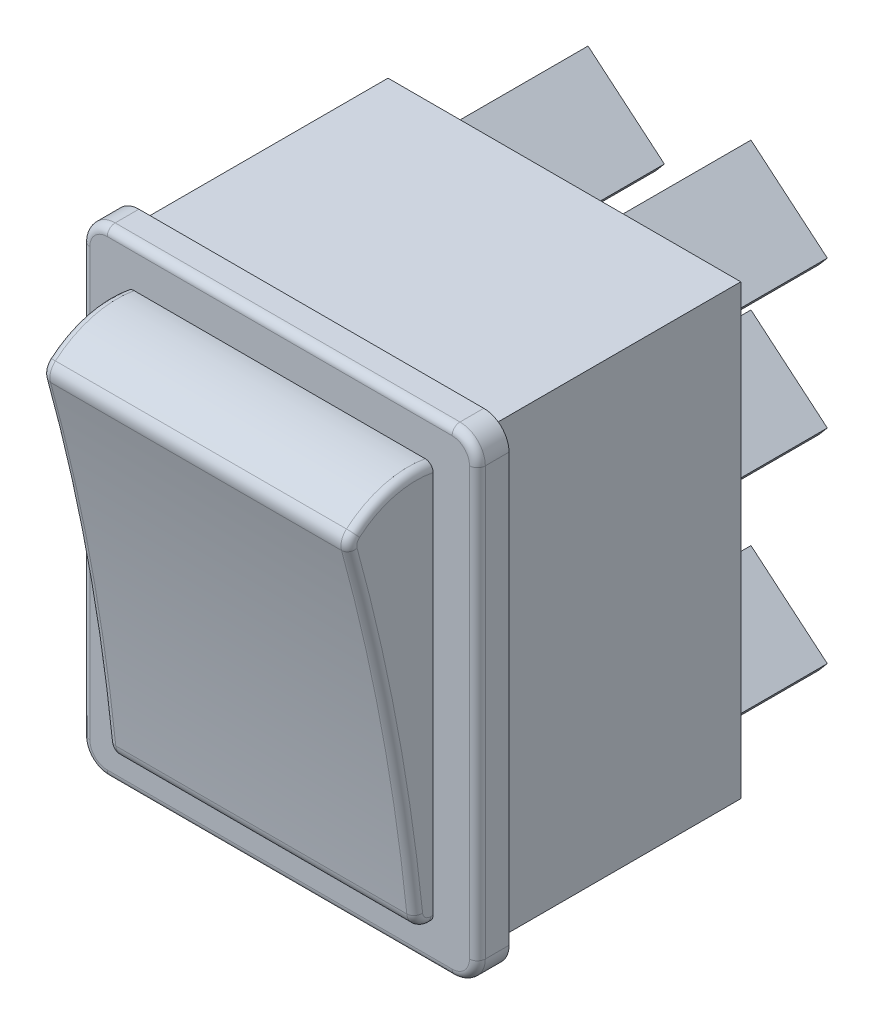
ISO-10303-21;
HEADER;
FILE_DESCRIPTION(('STEP AP214'),'2;1');
FILE_NAME('part.step','',(''),(''),'','','');
FILE_SCHEMA(('AUTOMOTIVE_DESIGN { 1 0 10303 214 1 1 1 1 }'));
ENDSEC;
DATA;
#1=APPLICATION_CONTEXT('core data for automotive mechanical design processes');
#2=APPLICATION_PROTOCOL_DEFINITION('international standard','automotive_design',2000,#1);
#3=PRODUCT_CONTEXT('',#1,'mechanical');
#4=PRODUCT('Part','Part','',(#3));
#5=PRODUCT_RELATED_PRODUCT_CATEGORY('part','',(#4));
#6=PRODUCT_DEFINITION_FORMATION('','',#4);
#7=PRODUCT_DEFINITION_CONTEXT('part definition',#1,'design');
#8=PRODUCT_DEFINITION('design','',#6,#7);
#9=PRODUCT_DEFINITION_SHAPE('','',#8);
#10=(LENGTH_UNIT() NAMED_UNIT(*) SI_UNIT(.MILLI.,.METRE.));
#11=(NAMED_UNIT(*) PLANE_ANGLE_UNIT() SI_UNIT($,.RADIAN.));
#12=(NAMED_UNIT(*) SI_UNIT($,.STERADIAN.) SOLID_ANGLE_UNIT());
#13=UNCERTAINTY_MEASURE_WITH_UNIT(LENGTH_MEASURE(1.E-05),#10,'distance_accuracy_value','');
#14=(GEOMETRIC_REPRESENTATION_CONTEXT(3) GLOBAL_UNCERTAINTY_ASSIGNED_CONTEXT((#13)) GLOBAL_UNIT_ASSIGNED_CONTEXT((#10,
#11,#12)) REPRESENTATION_CONTEXT('',''));
#15=CARTESIAN_POINT('',(0.,0.,0.));
#16=DIRECTION('',(0.,0.,1.));
#17=DIRECTION('',(1.,0.,0.));
#18=AXIS2_PLACEMENT_3D('',#15,#16,#17);
#19=CARTESIAN_POINT('',(23.65,29.25,-16.));
#20=DIRECTION('',(0.,0.,-1.));
#21=DIRECTION('',(-1.,0.,0.));
#22=AXIS2_PLACEMENT_3D('',#19,#20,#21);
#23=PLANE('',#22);
#24=DIRECTION('',(0.766044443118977,-0.642787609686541,0.));
#25=VECTOR('',#24,1.);
#26=CARTESIAN_POINT('',(5.19407504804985,28.5311987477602,-16.));
#27=LINE('',#26,#25);
#28=CARTESIAN_POINT('',(5.19407504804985,28.5311987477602,-16.));
#29=VERTEX_POINT('',#28);
#30=CARTESIAN_POINT('',(10.0201550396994,24.481636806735,-16.));
#31=VERTEX_POINT('',#30);
#32=EDGE_CURVE('E396',#29,#31,#27,.T.);
#33=ORIENTED_EDGE('',*,*,#32,.F.);
#34=DIRECTION('',(0.642787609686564,0.766044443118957,0.));
#35=VECTOR('',#34,1.);
#36=CARTESIAN_POINT('',(5.19407504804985,28.5311987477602,-16.));
#37=LINE('',#36,#35);
#38=CARTESIAN_POINT('',(4.67984496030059,27.918363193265,-16.));
#39=VERTEX_POINT('',#38);
#40=EDGE_CURVE('E393',#39,#29,#37,.T.);
#41=ORIENTED_EDGE('',*,*,#40,.F.);
#42=DIRECTION('',(-0.766044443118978,0.64278760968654,0.));
#43=VECTOR('',#42,1.);
#44=CARTESIAN_POINT('',(9.50592495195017,23.8688012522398,-16.));
#45=LINE('',#44,#43);
#46=CARTESIAN_POINT('',(9.50592495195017,23.8688012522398,-16.));
#47=VERTEX_POINT('',#46);
#48=EDGE_CURVE('E406',#47,#39,#45,.T.);
#49=ORIENTED_EDGE('',*,*,#48,.F.);
#50=DIRECTION('',(-0.642787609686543,-0.766044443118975,0.));
#51=VECTOR('',#50,1.);
#52=CARTESIAN_POINT('',(10.0201550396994,24.481636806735,-16.));
#53=LINE('',#52,#51);
#54=EDGE_CURVE('E414',#31,#47,#53,.T.);
#55=ORIENTED_EDGE('',*,*,#54,.F.);
#56=EDGE_LOOP('',(#33,#41,#49,#55));
#57=FACE_BOUND('',#56,.T.);
#58=DIRECTION('',(0.766044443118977,-0.642787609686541,0.));
#59=VECTOR('',#58,1.);
#60=CARTESIAN_POINT('',(15.4940750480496,6.33119874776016,-16.));
#61=LINE('',#60,#59);
#62=CARTESIAN_POINT('',(15.4940750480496,6.33119874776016,-16.));
#63=VERTEX_POINT('',#62);
#64=CARTESIAN_POINT('',(20.3201550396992,2.28163680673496,-16.));
#65=VERTEX_POINT('',#64);
#66=EDGE_CURVE('E470',#63,#65,#61,.T.);
#67=ORIENTED_EDGE('',*,*,#66,.F.);
#68=DIRECTION('',(0.642787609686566,0.766044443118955,0.));
#69=VECTOR('',#68,1.);
#70=CARTESIAN_POINT('',(15.4940750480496,6.33119874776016,-16.));
#71=LINE('',#70,#69);
#72=CARTESIAN_POINT('',(14.9798449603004,5.71836319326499,-16.));
#73=VERTEX_POINT('',#72);
#74=EDGE_CURVE('E456',#73,#63,#71,.T.);
#75=ORIENTED_EDGE('',*,*,#74,.F.);
#76=DIRECTION('',(-0.766044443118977,0.64278760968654,0.));
#77=VECTOR('',#76,1.);
#78=CARTESIAN_POINT('',(19.8059249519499,1.66880125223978,-16.));
#79=LINE('',#78,#77);
#80=CARTESIAN_POINT('',(19.8059249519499,1.66880125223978,-16.));
#81=VERTEX_POINT('',#80);
#82=EDGE_CURVE('E461',#81,#73,#79,.T.);
#83=ORIENTED_EDGE('',*,*,#82,.F.);
#84=DIRECTION('',(-0.642787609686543,-0.766044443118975,0.));
#85=VECTOR('',#84,1.);
#86=CARTESIAN_POINT('',(20.3201550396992,2.28163680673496,-16.));
#87=LINE('',#86,#85);
#88=EDGE_CURVE('E472',#65,#81,#87,.T.);
#89=ORIENTED_EDGE('',*,*,#88,.F.);
#90=EDGE_LOOP('',(#67,#75,#83,#89));
#91=FACE_BOUND('',#90,.T.);
#92=DIRECTION('',(0.766044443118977,-0.642787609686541,0.));
#93=VECTOR('',#92,1.);
#94=CARTESIAN_POINT('',(15.4940750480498,19.2311987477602,-16.));
#95=LINE('',#94,#93);
#96=CARTESIAN_POINT('',(15.4940750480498,19.2311987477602,-16.));
#97=VERTEX_POINT('',#96);
#98=CARTESIAN_POINT('',(20.3201550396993,15.181636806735,-16.));
#99=VERTEX_POINT('',#98);
#100=EDGE_CURVE('E528',#97,#99,#95,.T.);
#101=ORIENTED_EDGE('',*,*,#100,.F.);
#102=DIRECTION('',(0.642787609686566,0.766044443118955,0.));
#103=VECTOR('',#102,1.);
#104=CARTESIAN_POINT('',(15.4940750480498,19.2311987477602,-16.));
#105=LINE('',#104,#103);
#106=CARTESIAN_POINT('',(14.9798449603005,18.618363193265,-16.));
#107=VERTEX_POINT('',#106);
#108=EDGE_CURVE('E514',#107,#97,#105,.T.);
#109=ORIENTED_EDGE('',*,*,#108,.F.);
#110=DIRECTION('',(-0.766044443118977,0.64278760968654,0.));
#111=VECTOR('',#110,1.);
#112=CARTESIAN_POINT('',(19.8059249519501,14.5688012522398,-16.));
#113=LINE('',#112,#111);
#114=CARTESIAN_POINT('',(19.8059249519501,14.5688012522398,-16.));
#115=VERTEX_POINT('',#114);
#116=EDGE_CURVE('E519',#115,#107,#113,.T.);
#117=ORIENTED_EDGE('',*,*,#116,.F.);
#118=DIRECTION('',(-0.642787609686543,-0.766044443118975,0.));
#119=VECTOR('',#118,1.);
#120=CARTESIAN_POINT('',(20.3201550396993,15.181636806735,-16.));
#121=LINE('',#120,#119);
#122=EDGE_CURVE('E530',#99,#115,#121,.T.);
#123=ORIENTED_EDGE('',*,*,#122,.F.);
#124=EDGE_LOOP('',(#101,#109,#117,#123));
#125=FACE_BOUND('',#124,.T.);
#126=DIRECTION('',(0.,-1.,0.));
#127=VECTOR('',#126,1.);
#128=CARTESIAN_POINT('',(23.65,29.25,-16.));
#129=LINE('',#128,#127);
#130=CARTESIAN_POINT('',(23.65,29.25,-16.));
#131=VERTEX_POINT('',#130);
#132=CARTESIAN_POINT('',(23.65,0.950000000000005,-16.));
#133=VERTEX_POINT('',#132);
#134=EDGE_CURVE('E544',#131,#133,#129,.T.);
#135=ORIENTED_EDGE('',*,*,#134,.T.);
#136=DIRECTION('',(-1.,0.,0.));
#137=VECTOR('',#136,1.);
#138=CARTESIAN_POINT('',(23.65,0.950000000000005,-16.));
#139=LINE('',#138,#137);
#140=CARTESIAN_POINT('',(1.35,0.95,-16.));
#141=VERTEX_POINT('',#140);
#142=EDGE_CURVE('E547',#133,#141,#139,.T.);
#143=ORIENTED_EDGE('',*,*,#142,.T.);
#144=DIRECTION('',(0.,1.,0.));
#145=VECTOR('',#144,1.);
#146=CARTESIAN_POINT('',(1.35,29.25,-16.));
#147=LINE('',#146,#145);
#148=CARTESIAN_POINT('',(1.35,29.25,-16.));
#149=VERTEX_POINT('',#148);
#150=EDGE_CURVE('E550',#141,#149,#147,.T.);
#151=ORIENTED_EDGE('',*,*,#150,.T.);
#152=DIRECTION('',(1.,0.,0.));
#153=VECTOR('',#152,1.);
#154=CARTESIAN_POINT('',(23.65,29.25,-16.));
#155=LINE('',#154,#153);
#156=EDGE_CURVE('E552',#149,#131,#155,.T.);
#157=ORIENTED_EDGE('',*,*,#156,.T.);
#158=EDGE_LOOP('',(#135,#143,#151,#157));
#159=FACE_BOUND('',#158,.T.);
#160=DIRECTION('',(-0.642787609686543,-0.766044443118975,0.));
#161=VECTOR('',#160,1.);
#162=CARTESIAN_POINT('',(20.3201550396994,24.481636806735,-16.));
#163=LINE('',#162,#161);
#164=CARTESIAN_POINT('',(20.3201550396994,24.481636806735,-16.));
#165=VERTEX_POINT('',#164);
#166=CARTESIAN_POINT('',(19.8059249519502,23.8688012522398,-16.));
#167=VERTEX_POINT('',#166);
#168=EDGE_CURVE('E499',#165,#167,#163,.T.);
#169=ORIENTED_EDGE('',*,*,#168,.F.);
#170=DIRECTION('',(0.766044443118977,-0.642787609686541,0.));
#171=VECTOR('',#170,1.);
#172=CARTESIAN_POINT('',(15.4940750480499,28.5311987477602,-16.));
#173=LINE('',#172,#171);
#174=CARTESIAN_POINT('',(15.4940750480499,28.5311987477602,-16.));
#175=VERTEX_POINT('',#174);
#176=EDGE_CURVE('E485',#175,#165,#173,.T.);
#177=ORIENTED_EDGE('',*,*,#176,.F.);
#178=DIRECTION('',(0.642787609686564,0.766044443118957,0.));
#179=VECTOR('',#178,1.);
#180=CARTESIAN_POINT('',(15.4940750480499,28.5311987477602,-16.));
#181=LINE('',#180,#179);
#182=CARTESIAN_POINT('',(14.9798449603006,27.918363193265,-16.));
#183=VERTEX_POINT('',#182);
#184=EDGE_CURVE('E490',#183,#175,#181,.T.);
#185=ORIENTED_EDGE('',*,*,#184,.F.);
#186=DIRECTION('',(-0.766044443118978,0.64278760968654,0.));
#187=VECTOR('',#186,1.);
#188=CARTESIAN_POINT('',(19.8059249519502,23.8688012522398,-16.));
#189=LINE('',#188,#187);
#190=EDGE_CURVE('E501',#167,#183,#189,.T.);
#191=ORIENTED_EDGE('',*,*,#190,.F.);
#192=EDGE_LOOP('',(#169,#177,#185,#191));
#193=FACE_BOUND('',#192,.T.);
#194=DIRECTION('',(0.766044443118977,-0.642787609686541,0.));
#195=VECTOR('',#194,1.);
#196=CARTESIAN_POINT('',(5.19407504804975,19.2311987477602,-16.));
#197=LINE('',#196,#195);
#198=CARTESIAN_POINT('',(5.19407504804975,19.2311987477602,-16.));
#199=VERTEX_POINT('',#198);
#200=CARTESIAN_POINT('',(10.0201550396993,15.181636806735,-16.));
#201=VERTEX_POINT('',#200);
#202=EDGE_CURVE('E441',#199,#201,#197,.T.);
#203=ORIENTED_EDGE('',*,*,#202,.F.);
#204=DIRECTION('',(0.642787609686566,0.766044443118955,0.));
#205=VECTOR('',#204,1.);
#206=CARTESIAN_POINT('',(5.19407504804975,19.2311987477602,-16.));
#207=LINE('',#206,#205);
#208=CARTESIAN_POINT('',(4.6798449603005,18.618363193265,-16.));
#209=VERTEX_POINT('',#208);
#210=EDGE_CURVE('E427',#209,#199,#207,.T.);
#211=ORIENTED_EDGE('',*,*,#210,.F.);
#212=DIRECTION('',(-0.766044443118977,0.64278760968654,0.));
#213=VECTOR('',#212,1.);
#214=CARTESIAN_POINT('',(9.50592495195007,14.5688012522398,-16.));
#215=LINE('',#214,#213);
#216=CARTESIAN_POINT('',(9.50592495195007,14.5688012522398,-16.));
#217=VERTEX_POINT('',#216);
#218=EDGE_CURVE('E432',#217,#209,#215,.T.);
#219=ORIENTED_EDGE('',*,*,#218,.F.);
#220=DIRECTION('',(-0.642787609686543,-0.766044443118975,0.));
#221=VECTOR('',#220,1.);
#222=CARTESIAN_POINT('',(10.0201550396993,15.181636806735,-16.));
#223=LINE('',#222,#221);
#224=EDGE_CURVE('E443',#201,#217,#223,.T.);
#225=ORIENTED_EDGE('',*,*,#224,.F.);
#226=EDGE_LOOP('',(#203,#211,#219,#225));
#227=FACE_BOUND('',#226,.T.);
#228=DIRECTION('',(0.766044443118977,-0.642787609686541,0.));
#229=VECTOR('',#228,1.);
#230=CARTESIAN_POINT('',(5.19407504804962,6.33119874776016,-16.));
#231=LINE('',#230,#229);
#232=CARTESIAN_POINT('',(5.19407504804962,6.33119874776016,-16.));
#233=VERTEX_POINT('',#232);
#234=CARTESIAN_POINT('',(10.0201550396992,2.28163680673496,-16.));
#235=VERTEX_POINT('',#234);
#236=EDGE_CURVE('E803',#233,#235,#231,.T.);
#237=ORIENTED_EDGE('',*,*,#236,.F.);
#238=DIRECTION('',(0.642787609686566,0.766044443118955,0.));
#239=VECTOR('',#238,1.);
#240=CARTESIAN_POINT('',(5.19407504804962,6.33119874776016,-16.));
#241=LINE('',#240,#239);
#242=CARTESIAN_POINT('',(4.67984496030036,5.71836319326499,-16.));
#243=VERTEX_POINT('',#242);
#244=EDGE_CURVE('E391',#243,#233,#241,.T.);
#245=ORIENTED_EDGE('',*,*,#244,.F.);
#246=DIRECTION('',(-0.766044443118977,0.64278760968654,0.));
#247=VECTOR('',#246,1.);
#248=CARTESIAN_POINT('',(9.50592495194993,1.66880125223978,-16.));
#249=LINE('',#248,#247);
#250=CARTESIAN_POINT('',(9.50592495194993,1.66880125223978,-16.));
#251=VERTEX_POINT('',#250);
#252=EDGE_CURVE('E387',#251,#243,#249,.T.);
#253=ORIENTED_EDGE('',*,*,#252,.F.);
#254=DIRECTION('',(-0.642787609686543,-0.766044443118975,0.));
#255=VECTOR('',#254,1.);
#256=CARTESIAN_POINT('',(10.0201550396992,2.28163680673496,-16.));
#257=LINE('',#256,#255);
#258=EDGE_CURVE('E806',#235,#251,#257,.T.);
#259=ORIENTED_EDGE('',*,*,#258,.F.);
#260=EDGE_LOOP('',(#237,#245,#253,#259));
#261=FACE_BOUND('',#260,.T.);
#262=ADVANCED_FACE('F37',(#57,#91,#125,#159,#193,#227,#261),#23,.T.);
#263=CARTESIAN_POINT('',(0.,30.2,0.));
#264=DIRECTION('',(0.,0.,-1.));
#265=DIRECTION('',(-1.,0.,0.));
#266=AXIS2_PLACEMENT_3D('',#263,#264,#265);
#267=PLANE('',#266);
#268=DIRECTION('',(1.,0.,0.));
#269=VECTOR('',#268,1.);
#270=CARTESIAN_POINT('',(0.,0.,0.));
#271=LINE('',#270,#269);
#272=CARTESIAN_POINT('',(1.6,0.,0.));
#273=VERTEX_POINT('',#272);
#274=CARTESIAN_POINT('',(23.4,0.,0.));
#275=VERTEX_POINT('',#274);
#276=EDGE_CURVE('E575',#273,#275,#271,.T.);
#277=ORIENTED_EDGE('',*,*,#276,.F.);
#278=CARTESIAN_POINT('',(1.6,1.6,0.));
#279=DIRECTION('',(0.,0.,-1.));
#280=DIRECTION('',(-1.,0.,0.));
#281=AXIS2_PLACEMENT_3D('',#278,#279,#280);
#282=CIRCLE('',#281,1.6);
#283=CARTESIAN_POINT('',(0.,1.6,0.));
#284=VERTEX_POINT('',#283);
#285=EDGE_CURVE('E594',#273,#284,#282,.T.);
#286=ORIENTED_EDGE('',*,*,#285,.T.);
#287=DIRECTION('',(0.,-1.,0.));
#288=VECTOR('',#287,1.);
#289=CARTESIAN_POINT('',(0.,0.,0.));
#290=LINE('',#289,#288);
#291=CARTESIAN_POINT('',(0.,28.6,0.));
#292=VERTEX_POINT('',#291);
#293=EDGE_CURVE('E572',#292,#284,#290,.T.);
#294=ORIENTED_EDGE('',*,*,#293,.F.);
#295=CARTESIAN_POINT('',(1.6,28.6,0.));
#296=DIRECTION('',(0.,0.,-1.));
#297=DIRECTION('',(-1.,0.,0.));
#298=AXIS2_PLACEMENT_3D('',#295,#296,#297);
#299=CIRCLE('',#298,1.6);
#300=CARTESIAN_POINT('',(1.6,30.2,0.));
#301=VERTEX_POINT('',#300);
#302=EDGE_CURVE('E588',#292,#301,#299,.T.);
#303=ORIENTED_EDGE('',*,*,#302,.T.);
#304=DIRECTION('',(-1.,0.,0.));
#305=VECTOR('',#304,1.);
#306=CARTESIAN_POINT('',(0.,30.2,0.));
#307=LINE('',#306,#305);
#308=CARTESIAN_POINT('',(23.4,30.2,0.));
#309=VERTEX_POINT('',#308);
#310=EDGE_CURVE('E581',#309,#301,#307,.T.);
#311=ORIENTED_EDGE('',*,*,#310,.F.);
#312=CARTESIAN_POINT('',(23.4,28.6,0.));
#313=DIRECTION('',(0.,0.,-1.));
#314=DIRECTION('',(-1.,0.,0.));
#315=AXIS2_PLACEMENT_3D('',#312,#313,#314);
#316=CIRCLE('',#315,1.6);
#317=CARTESIAN_POINT('',(25.,28.6,0.));
#318=VERTEX_POINT('',#317);
#319=EDGE_CURVE('E590',#309,#318,#316,.T.);
#320=ORIENTED_EDGE('',*,*,#319,.T.);
#321=DIRECTION('',(0.,1.,0.));
#322=VECTOR('',#321,1.);
#323=CARTESIAN_POINT('',(25.,0.,0.));
#324=LINE('',#323,#322);
#325=CARTESIAN_POINT('',(25.,1.6,0.));
#326=VERTEX_POINT('',#325);
#327=EDGE_CURVE('E578',#326,#318,#324,.T.);
#328=ORIENTED_EDGE('',*,*,#327,.F.);
#329=CARTESIAN_POINT('',(23.4,1.6,0.));
#330=DIRECTION('',(0.,0.,-1.));
#331=DIRECTION('',(-1.,0.,0.));
#332=AXIS2_PLACEMENT_3D('',#329,#330,#331);
#333=CIRCLE('',#332,1.6);
#334=EDGE_CURVE('E592',#326,#275,#333,.T.);
#335=ORIENTED_EDGE('',*,*,#334,.T.);
#336=EDGE_LOOP('',(#277,#286,#294,#303,#311,#320,#328,#335));
#337=FACE_BOUND('',#336,.T.);
#338=DIRECTION('',(-1.,0.,0.));
#339=VECTOR('',#338,1.);
#340=CARTESIAN_POINT('',(23.65,0.950000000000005,0.));
#341=LINE('',#340,#339);
#342=CARTESIAN_POINT('',(23.65,0.950000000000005,0.));
#343=VERTEX_POINT('',#342);
#344=CARTESIAN_POINT('',(1.35,0.95,0.));
#345=VERTEX_POINT('',#344);
#346=EDGE_CURVE('E557',#343,#345,#341,.T.);
#347=ORIENTED_EDGE('',*,*,#346,.F.);
#348=DIRECTION('',(0.,-1.,0.));
#349=VECTOR('',#348,1.);
#350=CARTESIAN_POINT('',(23.65,29.25,0.));
#351=LINE('',#350,#349);
#352=CARTESIAN_POINT('',(23.65,29.25,0.));
#353=VERTEX_POINT('',#352);
#354=EDGE_CURVE('E543',#353,#343,#351,.T.);
#355=ORIENTED_EDGE('',*,*,#354,.F.);
#356=DIRECTION('',(1.,0.,0.));
#357=VECTOR('',#356,1.);
#358=CARTESIAN_POINT('',(23.65,29.25,0.));
#359=LINE('',#358,#357);
#360=CARTESIAN_POINT('',(1.35,29.25,0.));
#361=VERTEX_POINT('',#360);
#362=EDGE_CURVE('E548',#361,#353,#359,.T.);
#363=ORIENTED_EDGE('',*,*,#362,.F.);
#364=DIRECTION('',(0.,1.,0.));
#365=VECTOR('',#364,1.);
#366=CARTESIAN_POINT('',(1.35,29.25,0.));
#367=LINE('',#366,#365);
#368=EDGE_CURVE('E559',#345,#361,#367,.T.);
#369=ORIENTED_EDGE('',*,*,#368,.F.);
#370=EDGE_LOOP('',(#347,#355,#363,#369));
#371=FACE_BOUND('',#370,.T.);
#372=ADVANCED_FACE('F745',(#337,#371),#267,.T.);
#373=CARTESIAN_POINT('',(0.,0.,2.));
#374=DIRECTION('',(1.,0.,0.));
#375=DIRECTION('',(0.,0.,-1.));
#376=AXIS2_PLACEMENT_3D('',#373,#374,#375);
#377=PLANE('',#376);
#378=DIRECTION('',(0.,0.,-1.));
#379=VECTOR('',#378,1.);
#380=CARTESIAN_POINT('',(0.,1.6,2.));
#381=LINE('',#380,#379);
#382=CARTESIAN_POINT('',(0.,1.6,1.5));
#383=VERTEX_POINT('',#382);
#384=EDGE_CURVE('E598',#284,#383,#381,.F.);
#385=ORIENTED_EDGE('',*,*,#384,.T.);
#386=DIRECTION('',(0.,-1.,0.));
#387=VECTOR('',#386,1.);
#388=CARTESIAN_POINT('',(0.,0.,1.5));
#389=LINE('',#388,#387);
#390=CARTESIAN_POINT('',(0.,28.6,1.5));
#391=VERTEX_POINT('',#390);
#392=EDGE_CURVE('E900',#383,#391,#389,.F.);
#393=ORIENTED_EDGE('',*,*,#392,.T.);
#394=DIRECTION('',(0.,0.,-1.));
#395=VECTOR('',#394,1.);
#396=CARTESIAN_POINT('',(0.,28.6,2.));
#397=LINE('',#396,#395);
#398=EDGE_CURVE('E596',#391,#292,#397,.T.);
#399=ORIENTED_EDGE('',*,*,#398,.T.);
#400=ORIENTED_EDGE('',*,*,#293,.T.);
#401=EDGE_LOOP('',(#385,#393,#399,#400));
#402=FACE_BOUND('',#401,.T.);
#403=ADVANCED_FACE('F751',(#402),#377,.F.);
#404=CARTESIAN_POINT('',(0.,0.,2.));
#405=DIRECTION('',(0.,1.,0.));
#406=DIRECTION('',(0.,0.,1.));
#407=AXIS2_PLACEMENT_3D('',#404,#405,#406);
#408=PLANE('',#407);
#409=DIRECTION('',(0.,0.,-1.));
#410=VECTOR('',#409,1.);
#411=CARTESIAN_POINT('',(23.4,0.,2.));
#412=LINE('',#411,#410);
#413=CARTESIAN_POINT('',(23.4,0.,1.5));
#414=VERTEX_POINT('',#413);
#415=EDGE_CURVE('E584',#275,#414,#412,.F.);
#416=ORIENTED_EDGE('',*,*,#415,.T.);
#417=DIRECTION('',(1.,0.,0.));
#418=VECTOR('',#417,1.);
#419=CARTESIAN_POINT('',(0.,0.,1.5));
#420=LINE('',#419,#418);
#421=CARTESIAN_POINT('',(1.6,0.,1.5));
#422=VERTEX_POINT('',#421);
#423=EDGE_CURVE('E12',#414,#422,#420,.F.);
#424=ORIENTED_EDGE('',*,*,#423,.T.);
#425=DIRECTION('',(0.,0.,-1.));
#426=VECTOR('',#425,1.);
#427=CARTESIAN_POINT('',(1.6,0.,2.));
#428=LINE('',#427,#426);
#429=EDGE_CURVE('E586',#422,#273,#428,.T.);
#430=ORIENTED_EDGE('',*,*,#429,.T.);
#431=ORIENTED_EDGE('',*,*,#276,.T.);
#432=EDGE_LOOP('',(#416,#424,#430,#431));
#433=FACE_BOUND('',#432,.T.);
#434=ADVANCED_FACE('F966',(#433),#408,.F.);
#435=CARTESIAN_POINT('',(25.,0.,2.));
#436=DIRECTION('',(-1.,0.,0.));
#437=DIRECTION('',(0.,0.,1.));
#438=AXIS2_PLACEMENT_3D('',#435,#436,#437);
#439=PLANE('',#438);
#440=DIRECTION('',(0.,0.,-1.));
#441=VECTOR('',#440,1.);
#442=CARTESIAN_POINT('',(25.,28.6,2.));
#443=LINE('',#442,#441);
#444=CARTESIAN_POINT('',(25.,28.6,1.5));
#445=VERTEX_POINT('',#444);
#446=EDGE_CURVE('E601',#318,#445,#443,.F.);
#447=ORIENTED_EDGE('',*,*,#446,.T.);
#448=DIRECTION('',(0.,1.,0.));
#449=VECTOR('',#448,1.);
#450=CARTESIAN_POINT('',(25.,0.,1.5));
#451=LINE('',#450,#449);
#452=CARTESIAN_POINT('',(25.,1.6,1.5));
#453=VERTEX_POINT('',#452);
#454=EDGE_CURVE('E61',#445,#453,#451,.F.);
#455=ORIENTED_EDGE('',*,*,#454,.T.);
#456=DIRECTION('',(0.,0.,-1.));
#457=VECTOR('',#456,1.);
#458=CARTESIAN_POINT('',(25.,1.6,2.));
#459=LINE('',#458,#457);
#460=EDGE_CURVE('E603',#453,#326,#459,.T.);
#461=ORIENTED_EDGE('',*,*,#460,.T.);
#462=ORIENTED_EDGE('',*,*,#327,.T.);
#463=EDGE_LOOP('',(#447,#455,#461,#462));
#464=FACE_BOUND('',#463,.T.);
#465=ADVANCED_FACE('F939',(#464),#439,.F.);
#466=CARTESIAN_POINT('',(0.,30.2,2.));
#467=DIRECTION('',(0.,-1.,0.));
#468=DIRECTION('',(0.,0.,-1.));
#469=AXIS2_PLACEMENT_3D('',#466,#467,#468);
#470=PLANE('',#469);
#471=DIRECTION('',(0.,0.,-1.));
#472=VECTOR('',#471,1.);
#473=CARTESIAN_POINT('',(1.6,30.2,2.));
#474=LINE('',#473,#472);
#475=CARTESIAN_POINT('',(1.6,30.2,1.5));
#476=VERTEX_POINT('',#475);
#477=EDGE_CURVE('E605',#301,#476,#474,.F.);
#478=ORIENTED_EDGE('',*,*,#477,.T.);
#479=DIRECTION('',(-1.,0.,0.));
#480=VECTOR('',#479,1.);
#481=CARTESIAN_POINT('',(0.,30.2,1.5));
#482=LINE('',#481,#480);
#483=CARTESIAN_POINT('',(23.4,30.2,1.5));
#484=VERTEX_POINT('',#483);
#485=EDGE_CURVE('E904',#476,#484,#482,.F.);
#486=ORIENTED_EDGE('',*,*,#485,.T.);
#487=DIRECTION('',(0.,0.,-1.));
#488=VECTOR('',#487,1.);
#489=CARTESIAN_POINT('',(23.4,30.2,2.));
#490=LINE('',#489,#488);
#491=EDGE_CURVE('E608',#484,#309,#490,.T.);
#492=ORIENTED_EDGE('',*,*,#491,.T.);
#493=ORIENTED_EDGE('',*,*,#310,.T.);
#494=EDGE_LOOP('',(#478,#486,#492,#493));
#495=FACE_BOUND('',#494,.T.);
#496=ADVANCED_FACE('F948',(#495),#470,.F.);
#497=CARTESIAN_POINT('',(0.,30.2,2.));
#498=DIRECTION('',(0.,0.,-1.));
#499=DIRECTION('',(-1.,0.,0.));
#500=AXIS2_PLACEMENT_3D('',#497,#498,#499);
#501=PLANE('',#500);
#502=DIRECTION('',(0.,-1.,0.));
#503=VECTOR('',#502,1.);
#504=CARTESIAN_POINT('',(0.5,30.2,2.));
#505=LINE('',#504,#503);
#506=CARTESIAN_POINT('',(0.5,28.6,2.));
#507=VERTEX_POINT('',#506);
#508=CARTESIAN_POINT('',(0.5,1.6,2.));
#509=VERTEX_POINT('',#508);
#510=EDGE_CURVE('E892',#507,#509,#505,.T.);
#511=ORIENTED_EDGE('',*,*,#510,.T.);
#512=CARTESIAN_POINT('',(1.6,1.6,2.));
#513=DIRECTION('',(0.,0.,-1.));
#514=DIRECTION('',(-1.,0.,0.));
#515=AXIS2_PLACEMENT_3D('',#512,#513,#514);
#516=CIRCLE('',#515,1.1);
#517=CARTESIAN_POINT('',(1.6,0.5,2.));
#518=VERTEX_POINT('',#517);
#519=EDGE_CURVE('E894',#509,#518,#516,.F.);
#520=ORIENTED_EDGE('',*,*,#519,.T.);
#521=DIRECTION('',(1.,0.,0.));
#522=VECTOR('',#521,1.);
#523=CARTESIAN_POINT('',(0.,0.5,2.));
#524=LINE('',#523,#522);
#525=CARTESIAN_POINT('',(23.4,0.5,2.));
#526=VERTEX_POINT('',#525);
#527=EDGE_CURVE('E879',#518,#526,#524,.T.);
#528=ORIENTED_EDGE('',*,*,#527,.T.);
#529=CARTESIAN_POINT('',(23.4,1.6,2.));
#530=DIRECTION('',(0.,0.,-1.));
#531=DIRECTION('',(-1.,0.,0.));
#532=AXIS2_PLACEMENT_3D('',#529,#530,#531);
#533=CIRCLE('',#532,1.1);
#534=CARTESIAN_POINT('',(24.5,1.6,2.));
#535=VERTEX_POINT('',#534);
#536=EDGE_CURVE('E881',#526,#535,#533,.F.);
#537=ORIENTED_EDGE('',*,*,#536,.T.);
#538=DIRECTION('',(0.,1.,0.));
#539=VECTOR('',#538,1.);
#540=CARTESIAN_POINT('',(24.5,30.2,2.));
#541=LINE('',#540,#539);
#542=CARTESIAN_POINT('',(24.5,28.6,2.));
#543=VERTEX_POINT('',#542);
#544=EDGE_CURVE('E884',#535,#543,#541,.T.);
#545=ORIENTED_EDGE('',*,*,#544,.T.);
#546=CARTESIAN_POINT('',(23.4,28.6,2.));
#547=DIRECTION('',(0.,0.,-1.));
#548=DIRECTION('',(-1.,0.,0.));
#549=AXIS2_PLACEMENT_3D('',#546,#547,#548);
#550=CIRCLE('',#549,1.1);
#551=CARTESIAN_POINT('',(23.4,29.7,2.));
#552=VERTEX_POINT('',#551);
#553=EDGE_CURVE('E886',#543,#552,#550,.F.);
#554=ORIENTED_EDGE('',*,*,#553,.T.);
#555=DIRECTION('',(-1.,0.,0.));
#556=VECTOR('',#555,1.);
#557=CARTESIAN_POINT('',(0.,29.7,2.));
#558=LINE('',#557,#556);
#559=CARTESIAN_POINT('',(1.6,29.7,2.));
#560=VERTEX_POINT('',#559);
#561=EDGE_CURVE('E888',#552,#560,#558,.T.);
#562=ORIENTED_EDGE('',*,*,#561,.T.);
#563=CARTESIAN_POINT('',(1.6,28.6,2.));
#564=DIRECTION('',(0.,0.,-1.));
#565=DIRECTION('',(-1.,0.,0.));
#566=AXIS2_PLACEMENT_3D('',#563,#564,#565);
#567=CIRCLE('',#566,1.1);
#568=EDGE_CURVE('E890',#560,#507,#567,.F.);
#569=ORIENTED_EDGE('',*,*,#568,.T.);
#570=EDGE_LOOP('',(#511,#520,#528,#537,#545,#554,#562,#569));
#571=FACE_BOUND('',#570,.T.);
#572=DIRECTION('',(0.,-1.,0.));
#573=VECTOR('',#572,1.);
#574=CARTESIAN_POINT('',(2.8,2.3484115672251,2.));
#575=LINE('',#574,#573);
#576=CARTESIAN_POINT('',(2.8,27.0800662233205,2.));
#577=VERTEX_POINT('',#576);
#578=CARTESIAN_POINT('',(2.8,2.8484115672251,2.));
#579=VERTEX_POINT('',#578);
#580=EDGE_CURVE('E809',#577,#579,#575,.T.);
#581=ORIENTED_EDGE('',*,*,#580,.F.);
#582=CARTESIAN_POINT('',(2.8,27.0800662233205,2.));
#583=CARTESIAN_POINT('',(2.79997756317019,27.1091016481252,2.));
#584=CARTESIAN_POINT('',(2.80243109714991,27.1381344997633,2.));
#585=CARTESIAN_POINT('',(2.81213917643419,27.1953815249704,2.));
#586=CARTESIAN_POINT('',(2.81939292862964,27.2235958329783,2.));
#587=CARTESIAN_POINT('',(2.83855770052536,27.2784226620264,2.));
#588=CARTESIAN_POINT('',(2.85047216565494,27.3050339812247,2.));
#589=CARTESIAN_POINT('',(2.87863976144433,27.3558416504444,2.));
#590=CARTESIAN_POINT('',(2.89489130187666,27.3800388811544,2.));
#591=CARTESIAN_POINT('',(2.93111132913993,27.425064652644,2.));
#592=CARTESIAN_POINT('',(2.95104020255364,27.4459250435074,2.));
#593=CARTESIAN_POINT('',(2.99417735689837,27.4839375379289,2.));
#594=CARTESIAN_POINT('',(3.01738617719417,27.5010890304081,2.));
#595=CARTESIAN_POINT('',(3.06599345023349,27.5308813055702,2.));
#596=CARTESIAN_POINT('',(3.09134813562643,27.5435935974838,2.));
#597=CARTESIAN_POINT('',(3.14384586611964,27.5645018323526,2.));
#598=CARTESIAN_POINT('',(3.17098740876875,27.5727015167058,2.));
#599=CARTESIAN_POINT('',(3.21528083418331,27.5820279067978,2.));
#600=CARTESIAN_POINT('',(3.23212817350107,27.5846698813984,2.));
#601=CARTESIAN_POINT('',(3.26598105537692,27.5881939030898,2.));
#602=CARTESIAN_POINT('',(3.28298633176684,27.5890785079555,2.));
#603=CARTESIAN_POINT('',(3.3,27.5890769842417,2.));
#604=B_SPLINE_CURVE_WITH_KNOTS('',3,(#582,#583,#584,#585,#586,#587,#588,#589,#590,#591,#592,
#593,#594,#595,#596,#597,#598,#599,#600,#601,#602,#603),.UNSPECIFIED.,.F.,.F.,(4,2,2,2,2,2,2,2,
2,2,4),(0.,0.0869997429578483,0.173985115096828,0.261034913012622,0.348052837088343,
0.434182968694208,0.520327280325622,0.605011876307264,0.689626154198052,0.740702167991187,
0.791703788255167),.UNSPECIFIED.);
#605=CARTESIAN_POINT('',(3.3,27.5890769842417,2.));
#606=VERTEX_POINT('',#605);
#607=EDGE_CURVE('E666',#577,#606,#604,.T.);
#608=ORIENTED_EDGE('',*,*,#607,.T.);
#609=DIRECTION('',(1.,0.,0.));
#610=VECTOR('',#609,1.);
#611=CARTESIAN_POINT('',(-25.9160052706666,27.5890769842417,2.));
#612=LINE('',#611,#610);
#613=CARTESIAN_POINT('',(21.7,27.5890769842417,2.));
#614=VERTEX_POINT('',#613);
#615=EDGE_CURVE('E825',#606,#614,#612,.T.);
#616=ORIENTED_EDGE('',*,*,#615,.T.);
#617=CARTESIAN_POINT('',(21.7,27.5890769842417,2.));
#618=CARTESIAN_POINT('',(21.7277908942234,27.589102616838,2.));
#619=CARTESIAN_POINT('',(21.7555721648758,27.58672342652,2.));
#620=CARTESIAN_POINT('',(21.8103108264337,27.577347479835,2.));
#621=CARTESIAN_POINT('',(21.837269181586,27.5703563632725,2.));
#622=CARTESIAN_POINT('',(21.8896377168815,27.5519447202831,2.));
#623=CARTESIAN_POINT('',(21.9150473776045,27.5405227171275,2.));
#624=CARTESIAN_POINT('',(21.9636040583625,27.5136052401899,2.));
#625=CARTESIAN_POINT('',(21.9867512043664,27.4981099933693,2.));
#626=CARTESIAN_POINT('',(22.0303057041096,27.4633868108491,2.));
#627=CARTESIAN_POINT('',(22.0506936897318,27.4441345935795,2.));
#628=CARTESIAN_POINT('',(22.0880111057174,27.4025238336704,2.));
#629=CARTESIAN_POINT('',(22.1049398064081,27.3801646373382,2.));
#630=CARTESIAN_POINT('',(22.1351390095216,27.3326082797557,2.));
#631=CARTESIAN_POINT('',(22.1483481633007,27.3073722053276,2.));
#632=CARTESIAN_POINT('',(22.1704174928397,27.2550686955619,2.));
#633=CARTESIAN_POINT('',(22.1792790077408,27.2280018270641,2.));
#634=CARTESIAN_POINT('',(22.1905618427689,27.1806993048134,2.));
#635=CARTESIAN_POINT('',(22.1940999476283,27.1607221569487,2.));
#636=CARTESIAN_POINT('',(22.1988189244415,27.1205209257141,2.));
#637=CARTESIAN_POINT('',(22.2000032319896,27.1002972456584,2.));
#638=CARTESIAN_POINT('',(22.2,27.0800662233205,2.));
#639=B_SPLINE_CURVE_WITH_KNOTS('',3,(#617,#618,#619,#620,#621,#622,#623,#624,#625,#626,#627,
#628,#629,#630,#631,#632,#633,#634,#635,#636,#637,#638),.UNSPECIFIED.,.F.,.F.,(4,2,2,2,2,2,2,2,
2,2,4),(0.,0.0832567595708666,0.166411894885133,0.249594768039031,0.332773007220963,
0.41650778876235,0.500260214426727,0.585322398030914,0.670358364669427,0.731091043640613,
0.791735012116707),.UNSPECIFIED.);
#640=CARTESIAN_POINT('',(22.2,27.0800662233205,2.));
#641=VERTEX_POINT('',#640);
#642=EDGE_CURVE('E673',#614,#641,#639,.T.);
#643=ORIENTED_EDGE('',*,*,#642,.T.);
#644=DIRECTION('',(0.,1.,0.));
#645=VECTOR('',#644,1.);
#646=CARTESIAN_POINT('',(22.2,2.3484115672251,2.));
#647=LINE('',#646,#645);
#648=CARTESIAN_POINT('',(22.2,2.8484115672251,2.));
#649=VERTEX_POINT('',#648);
#650=EDGE_CURVE('E826',#649,#641,#647,.T.);
#651=ORIENTED_EDGE('',*,*,#650,.F.);
#652=CARTESIAN_POINT('',(21.7,2.8484115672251,2.));
#653=DIRECTION('',(0.,0.,-1.));
#654=DIRECTION('',(-1.,0.,0.));
#655=AXIS2_PLACEMENT_3D('',#652,#653,#654);
#656=CIRCLE('',#655,0.5);
#657=CARTESIAN_POINT('',(21.7,2.3484115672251,2.));
#658=VERTEX_POINT('',#657);
#659=EDGE_CURVE('E882',#649,#658,#656,.T.);
#660=ORIENTED_EDGE('',*,*,#659,.T.);
#661=DIRECTION('',(1.,0.,0.));
#662=VECTOR('',#661,1.);
#663=CARTESIAN_POINT('',(-25.9160052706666,2.3484115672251,2.));
#664=LINE('',#663,#662);
#665=CARTESIAN_POINT('',(3.3,2.3484115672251,2.));
#666=VERTEX_POINT('',#665);
#667=EDGE_CURVE('E822',#666,#658,#664,.T.);
#668=ORIENTED_EDGE('',*,*,#667,.F.);
#669=CARTESIAN_POINT('',(3.3,2.8484115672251,2.));
#670=DIRECTION('',(0.,0.,-1.));
#671=DIRECTION('',(-1.,0.,0.));
#672=AXIS2_PLACEMENT_3D('',#669,#670,#671);
#673=CIRCLE('',#672,0.5);
#674=EDGE_CURVE('E664',#666,#579,#673,.T.);
#675=ORIENTED_EDGE('',*,*,#674,.T.);
#676=EDGE_LOOP('',(#581,#608,#616,#643,#651,#660,#668,#675));
#677=FACE_BOUND('',#676,.T.);
#678=ADVANCED_FACE('F679',(#571,#677),#501,.F.);
#679=CARTESIAN_POINT('',(1.6,1.6,2.));
#680=DIRECTION('',(0.,0.,-1.));
#681=DIRECTION('',(-1.,0.,0.));
#682=AXIS2_PLACEMENT_3D('',#679,#680,#681);
#683=CYLINDRICAL_SURFACE('',#682,1.6);
#684=ORIENTED_EDGE('',*,*,#429,.F.);
#685=CARTESIAN_POINT('',(1.6,1.6,1.5));
#686=DIRECTION('',(0.,0.,-1.));
#687=DIRECTION('',(-1.,0.,0.));
#688=AXIS2_PLACEMENT_3D('',#685,#686,#687);
#689=CIRCLE('',#688,1.6);
#690=EDGE_CURVE('E897',#422,#383,#689,.T.);
#691=ORIENTED_EDGE('',*,*,#690,.T.);
#692=ORIENTED_EDGE('',*,*,#384,.F.);
#693=ORIENTED_EDGE('',*,*,#285,.F.);
#694=EDGE_LOOP('',(#684,#691,#692,#693));
#695=FACE_BOUND('',#694,.T.);
#696=ADVANCED_FACE('F970',(#695),#683,.T.);
#697=CARTESIAN_POINT('',(23.4,1.6,2.));
#698=DIRECTION('',(0.,0.,-1.));
#699=DIRECTION('',(-1.,0.,0.));
#700=AXIS2_PLACEMENT_3D('',#697,#698,#699);
#701=CYLINDRICAL_SURFACE('',#700,1.6);
#702=ORIENTED_EDGE('',*,*,#460,.F.);
#703=CARTESIAN_POINT('',(23.4,1.6,1.5));
#704=DIRECTION('',(0.,0.,-1.));
#705=DIRECTION('',(-1.,0.,0.));
#706=AXIS2_PLACEMENT_3D('',#703,#704,#705);
#707=CIRCLE('',#706,1.6);
#708=EDGE_CURVE('E46',#453,#414,#707,.T.);
#709=ORIENTED_EDGE('',*,*,#708,.T.);
#710=ORIENTED_EDGE('',*,*,#415,.F.);
#711=ORIENTED_EDGE('',*,*,#334,.F.);
#712=EDGE_LOOP('',(#702,#709,#710,#711));
#713=FACE_BOUND('',#712,.T.);
#714=ADVANCED_FACE('F972',(#713),#701,.T.);
#715=CARTESIAN_POINT('',(23.4,28.6,2.));
#716=DIRECTION('',(0.,0.,-1.));
#717=DIRECTION('',(-1.,0.,0.));
#718=AXIS2_PLACEMENT_3D('',#715,#716,#717);
#719=CYLINDRICAL_SURFACE('',#718,1.6);
#720=ORIENTED_EDGE('',*,*,#491,.F.);
#721=CARTESIAN_POINT('',(23.4,28.6,1.5));
#722=DIRECTION('',(0.,0.,-1.));
#723=DIRECTION('',(-1.,0.,0.));
#724=AXIS2_PLACEMENT_3D('',#721,#722,#723);
#725=CIRCLE('',#724,1.6);
#726=EDGE_CURVE('E906',#484,#445,#725,.T.);
#727=ORIENTED_EDGE('',*,*,#726,.T.);
#728=ORIENTED_EDGE('',*,*,#446,.F.);
#729=ORIENTED_EDGE('',*,*,#319,.F.);
#730=EDGE_LOOP('',(#720,#727,#728,#729));
#731=FACE_BOUND('',#730,.T.);
#732=ADVANCED_FACE('F777',(#731),#719,.T.);
#733=CARTESIAN_POINT('',(1.6,28.6,2.));
#734=DIRECTION('',(0.,0.,-1.));
#735=DIRECTION('',(-1.,0.,0.));
#736=AXIS2_PLACEMENT_3D('',#733,#734,#735);
#737=CYLINDRICAL_SURFACE('',#736,1.6);
#738=ORIENTED_EDGE('',*,*,#398,.F.);
#739=CARTESIAN_POINT('',(1.6,28.6,1.5));
#740=DIRECTION('',(0.,0.,-1.));
#741=DIRECTION('',(-1.,0.,0.));
#742=AXIS2_PLACEMENT_3D('',#739,#740,#741);
#743=CIRCLE('',#742,1.6);
#744=EDGE_CURVE('E902',#391,#476,#743,.T.);
#745=ORIENTED_EDGE('',*,*,#744,.T.);
#746=ORIENTED_EDGE('',*,*,#477,.F.);
#747=ORIENTED_EDGE('',*,*,#302,.F.);
#748=EDGE_LOOP('',(#738,#745,#746,#747));
#749=FACE_BOUND('',#748,.T.);
#750=ADVANCED_FACE('F772',(#749),#737,.T.);
#751=CARTESIAN_POINT('',(23.65,29.25,-16.));
#752=DIRECTION('',(-1.,0.,0.));
#753=DIRECTION('',(0.,0.,1.));
#754=AXIS2_PLACEMENT_3D('',#751,#752,#753);
#755=PLANE('',#754);
#756=ORIENTED_EDGE('',*,*,#354,.T.);
#757=DIRECTION('',(0.,0.,1.));
#758=VECTOR('',#757,1.);
#759=CARTESIAN_POINT('',(23.65,0.950000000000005,-16.));
#760=LINE('',#759,#758);
#761=EDGE_CURVE('E570',#133,#343,#760,.T.);
#762=ORIENTED_EDGE('',*,*,#761,.F.);
#763=ORIENTED_EDGE('',*,*,#134,.F.);
#764=DIRECTION('',(0.,0.,1.));
#765=VECTOR('',#764,1.);
#766=CARTESIAN_POINT('',(23.65,29.25,-16.));
#767=LINE('',#766,#765);
#768=EDGE_CURVE('E554',#131,#353,#767,.T.);
#769=ORIENTED_EDGE('',*,*,#768,.T.);
#770=EDGE_LOOP('',(#756,#762,#763,#769));
#771=FACE_BOUND('',#770,.T.);
#772=ADVANCED_FACE('F769',(#771),#755,.F.);
#773=CARTESIAN_POINT('',(23.65,0.950000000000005,-16.));
#774=DIRECTION('',(0.,1.,0.));
#775=DIRECTION('',(-1.,0.,0.));
#776=AXIS2_PLACEMENT_3D('',#773,#774,#775);
#777=PLANE('',#776);
#778=ORIENTED_EDGE('',*,*,#346,.T.);
#779=DIRECTION('',(0.,0.,1.));
#780=VECTOR('',#779,1.);
#781=CARTESIAN_POINT('',(1.35,0.95,-16.));
#782=LINE('',#781,#780);
#783=EDGE_CURVE('E567',#141,#345,#782,.T.);
#784=ORIENTED_EDGE('',*,*,#783,.F.);
#785=ORIENTED_EDGE('',*,*,#142,.F.);
#786=ORIENTED_EDGE('',*,*,#761,.T.);
#787=EDGE_LOOP('',(#778,#784,#785,#786));
#788=FACE_BOUND('',#787,.T.);
#789=ADVANCED_FACE('F766',(#788),#777,.F.);
#790=CARTESIAN_POINT('',(1.35,29.25,-16.));
#791=DIRECTION('',(1.,0.,0.));
#792=DIRECTION('',(0.,1.,0.));
#793=AXIS2_PLACEMENT_3D('',#790,#791,#792);
#794=PLANE('',#793);
#795=ORIENTED_EDGE('',*,*,#368,.T.);
#796=DIRECTION('',(0.,0.,1.));
#797=VECTOR('',#796,1.);
#798=CARTESIAN_POINT('',(1.35,29.25,-16.));
#799=LINE('',#798,#797);
#800=EDGE_CURVE('E565',#149,#361,#799,.T.);
#801=ORIENTED_EDGE('',*,*,#800,.F.);
#802=ORIENTED_EDGE('',*,*,#150,.F.);
#803=ORIENTED_EDGE('',*,*,#783,.T.);
#804=EDGE_LOOP('',(#795,#801,#802,#803));
#805=FACE_BOUND('',#804,.T.);
#806=ADVANCED_FACE('F762',(#805),#794,.F.);
#807=CARTESIAN_POINT('',(23.65,29.25,-16.));
#808=DIRECTION('',(0.,-1.,0.));
#809=DIRECTION('',(1.,0.,0.));
#810=AXIS2_PLACEMENT_3D('',#807,#808,#809);
#811=PLANE('',#810);
#812=ORIENTED_EDGE('',*,*,#362,.T.);
#813=ORIENTED_EDGE('',*,*,#768,.F.);
#814=ORIENTED_EDGE('',*,*,#156,.F.);
#815=ORIENTED_EDGE('',*,*,#800,.T.);
#816=EDGE_LOOP('',(#812,#813,#814,#815));
#817=FACE_BOUND('',#816,.T.);
#818=ADVANCED_FACE('F759',(#817),#811,.F.);
#819=CARTESIAN_POINT('',(15.4940750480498,19.2311987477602,-24.8));
#820=DIRECTION('',(0.766044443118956,-0.642787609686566,0.));
#821=DIRECTION('',(0.642787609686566,0.766044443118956,0.));
#822=AXIS2_PLACEMENT_3D('',#819,#820,#821);
#823=PLANE('',#822);
#824=ORIENTED_EDGE('',*,*,#108,.T.);
#825=DIRECTION('',(0.,0.,1.));
#826=VECTOR('',#825,1.);
#827=CARTESIAN_POINT('',(15.4940750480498,19.2311987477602,-24.8));
#828=LINE('',#827,#826);
#829=CARTESIAN_POINT('',(15.4940750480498,19.2311987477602,-24.8));
#830=VERTEX_POINT('',#829);
#831=EDGE_CURVE('E541',#830,#97,#828,.T.);
#832=ORIENTED_EDGE('',*,*,#831,.F.);
#833=DIRECTION('',(0.642787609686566,0.766044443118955,0.));
#834=VECTOR('',#833,1.);
#835=CARTESIAN_POINT('',(15.4940750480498,19.2311987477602,-24.8));
#836=LINE('',#835,#834);
#837=CARTESIAN_POINT('',(14.9798449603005,18.618363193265,-24.8));
#838=VERTEX_POINT('',#837);
#839=EDGE_CURVE('E515',#838,#830,#836,.T.);
#840=ORIENTED_EDGE('',*,*,#839,.F.);
#841=DIRECTION('',(0.,0.,1.));
#842=VECTOR('',#841,1.);
#843=CARTESIAN_POINT('',(14.9798449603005,18.618363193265,-24.8));
#844=LINE('',#843,#842);
#845=EDGE_CURVE('E525',#838,#107,#844,.T.);
#846=ORIENTED_EDGE('',*,*,#845,.T.);
#847=EDGE_LOOP('',(#824,#832,#840,#846));
#848=FACE_BOUND('',#847,.T.);
#849=ADVANCED_FACE('F757',(#848),#823,.F.);
#850=CARTESIAN_POINT('',(15.4940750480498,19.2311987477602,-24.8));
#851=DIRECTION('',(-0.642787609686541,-0.766044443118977,0.));
#852=DIRECTION('',(0.766044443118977,-0.642787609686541,0.));
#853=AXIS2_PLACEMENT_3D('',#850,#851,#852);
#854=PLANE('',#853);
#855=ORIENTED_EDGE('',*,*,#100,.T.);
#856=DIRECTION('',(0.,0.,1.));
#857=VECTOR('',#856,1.);
#858=CARTESIAN_POINT('',(20.3201550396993,15.181636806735,-24.8));
#859=LINE('',#858,#857);
#860=CARTESIAN_POINT('',(20.3201550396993,15.181636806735,-24.8));
#861=VERTEX_POINT('',#860);
#862=EDGE_CURVE('E538',#861,#99,#859,.T.);
#863=ORIENTED_EDGE('',*,*,#862,.F.);
#864=DIRECTION('',(0.766044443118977,-0.642787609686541,0.));
#865=VECTOR('',#864,1.);
#866=CARTESIAN_POINT('',(15.4940750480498,19.2311987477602,-24.8));
#867=LINE('',#866,#865);
#868=EDGE_CURVE('E518',#830,#861,#867,.T.);
#869=ORIENTED_EDGE('',*,*,#868,.F.);
#870=ORIENTED_EDGE('',*,*,#831,.T.);
#871=EDGE_LOOP('',(#855,#863,#869,#870));
#872=FACE_BOUND('',#871,.T.);
#873=ADVANCED_FACE('F1140',(#872),#854,.F.);
#874=CARTESIAN_POINT('',(20.3201550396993,15.181636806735,-24.8));
#875=DIRECTION('',(-0.766044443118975,0.642787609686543,0.));
#876=DIRECTION('',(-0.642787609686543,-0.766044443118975,0.));
#877=AXIS2_PLACEMENT_3D('',#874,#875,#876);
#878=PLANE('',#877);
#879=ORIENTED_EDGE('',*,*,#122,.T.);
#880=DIRECTION('',(0.,0.,1.));
#881=VECTOR('',#880,1.);
#882=CARTESIAN_POINT('',(19.8059249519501,14.5688012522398,-24.8));
#883=LINE('',#882,#881);
#884=CARTESIAN_POINT('',(19.8059249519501,14.5688012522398,-24.8));
#885=VERTEX_POINT('',#884);
#886=EDGE_CURVE('E536',#885,#115,#883,.T.);
#887=ORIENTED_EDGE('',*,*,#886,.F.);
#888=DIRECTION('',(-0.642787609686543,-0.766044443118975,0.));
#889=VECTOR('',#888,1.);
#890=CARTESIAN_POINT('',(20.3201550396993,15.181636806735,-24.8));
#891=LINE('',#890,#889);
#892=EDGE_CURVE('E521',#861,#885,#891,.T.);
#893=ORIENTED_EDGE('',*,*,#892,.F.);
#894=ORIENTED_EDGE('',*,*,#862,.T.);
#895=EDGE_LOOP('',(#879,#887,#893,#894));
#896=FACE_BOUND('',#895,.T.);
#897=ADVANCED_FACE('F1137',(#896),#878,.F.);
#898=CARTESIAN_POINT('',(19.8059249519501,14.5688012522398,-24.8));
#899=DIRECTION('',(0.64278760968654,0.766044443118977,0.));
#900=DIRECTION('',(-0.766044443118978,0.64278760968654,0.));
#901=AXIS2_PLACEMENT_3D('',#898,#899,#900);
#902=PLANE('',#901);
#903=ORIENTED_EDGE('',*,*,#116,.T.);
#904=ORIENTED_EDGE('',*,*,#845,.F.);
#905=DIRECTION('',(-0.766044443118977,0.64278760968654,0.));
#906=VECTOR('',#905,1.);
#907=CARTESIAN_POINT('',(19.8059249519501,14.5688012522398,-24.8));
#908=LINE('',#907,#906);
#909=EDGE_CURVE('E523',#885,#838,#908,.T.);
#910=ORIENTED_EDGE('',*,*,#909,.F.);
#911=ORIENTED_EDGE('',*,*,#886,.T.);
#912=EDGE_LOOP('',(#903,#904,#910,#911));
#913=FACE_BOUND('',#912,.T.);
#914=ADVANCED_FACE('F1133',(#913),#902,.F.);
#915=CARTESIAN_POINT('',(15.4940750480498,19.2311987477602,-24.8));
#916=DIRECTION('',(0.,0.,1.));
#917=DIRECTION('',(1.,0.,0.));
#918=AXIS2_PLACEMENT_3D('',#915,#916,#917);
#919=PLANE('',#918);
#920=ORIENTED_EDGE('',*,*,#839,.T.);
#921=ORIENTED_EDGE('',*,*,#868,.T.);
#922=ORIENTED_EDGE('',*,*,#892,.T.);
#923=ORIENTED_EDGE('',*,*,#909,.T.);
#924=EDGE_LOOP('',(#920,#921,#922,#923));
#925=FACE_BOUND('',#924,.T.);
#926=ADVANCED_FACE('F1129',(#925),#919,.F.);
#927=CARTESIAN_POINT('',(15.4940750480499,28.5311987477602,-24.8));
#928=DIRECTION('',(-0.642787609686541,-0.766044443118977,0.));
#929=DIRECTION('',(0.766044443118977,-0.642787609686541,0.));
#930=AXIS2_PLACEMENT_3D('',#927,#928,#929);
#931=PLANE('',#930);
#932=ORIENTED_EDGE('',*,*,#176,.T.);
#933=DIRECTION('',(0.,0.,1.));
#934=VECTOR('',#933,1.);
#935=CARTESIAN_POINT('',(20.3201550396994,24.481636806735,-24.8));
#936=LINE('',#935,#934);
#937=CARTESIAN_POINT('',(20.3201550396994,24.481636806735,-24.8));
#938=VERTEX_POINT('',#937);
#939=EDGE_CURVE('E512',#938,#165,#936,.T.);
#940=ORIENTED_EDGE('',*,*,#939,.F.);
#941=DIRECTION('',(0.766044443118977,-0.642787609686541,0.));
#942=VECTOR('',#941,1.);
#943=CARTESIAN_POINT('',(15.4940750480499,28.5311987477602,-24.8));
#944=LINE('',#943,#942);
#945=CARTESIAN_POINT('',(15.4940750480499,28.5311987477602,-24.8));
#946=VERTEX_POINT('',#945);
#947=EDGE_CURVE('E486',#946,#938,#944,.T.);
#948=ORIENTED_EDGE('',*,*,#947,.F.);
#949=DIRECTION('',(0.,0.,1.));
#950=VECTOR('',#949,1.);
#951=CARTESIAN_POINT('',(15.4940750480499,28.5311987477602,-24.8));
#952=LINE('',#951,#950);
#953=EDGE_CURVE('E496',#946,#175,#952,.T.);
#954=ORIENTED_EDGE('',*,*,#953,.T.);
#955=EDGE_LOOP('',(#932,#940,#948,#954));
#956=FACE_BOUND('',#955,.T.);
#957=ADVANCED_FACE('F1125',(#956),#931,.F.);
#958=CARTESIAN_POINT('',(20.3201550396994,24.481636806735,-24.8));
#959=DIRECTION('',(-0.766044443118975,0.642787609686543,0.));
#960=DIRECTION('',(-0.642787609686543,-0.766044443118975,0.));
#961=AXIS2_PLACEMENT_3D('',#958,#959,#960);
#962=PLANE('',#961);
#963=ORIENTED_EDGE('',*,*,#168,.T.);
#964=DIRECTION('',(0.,0.,1.));
#965=VECTOR('',#964,1.);
#966=CARTESIAN_POINT('',(19.8059249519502,23.8688012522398,-24.8));
#967=LINE('',#966,#965);
#968=CARTESIAN_POINT('',(19.8059249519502,23.8688012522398,-24.8));
#969=VERTEX_POINT('',#968);
#970=EDGE_CURVE('E509',#969,#167,#967,.T.);
#971=ORIENTED_EDGE('',*,*,#970,.F.);
#972=DIRECTION('',(-0.642787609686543,-0.766044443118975,0.));
#973=VECTOR('',#972,1.);
#974=CARTESIAN_POINT('',(20.3201550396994,24.481636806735,-24.8));
#975=LINE('',#974,#973);
#976=EDGE_CURVE('E489',#938,#969,#975,.T.);
#977=ORIENTED_EDGE('',*,*,#976,.F.);
#978=ORIENTED_EDGE('',*,*,#939,.T.);
#979=EDGE_LOOP('',(#963,#971,#977,#978));
#980=FACE_BOUND('',#979,.T.);
#981=ADVANCED_FACE('F1121',(#980),#962,.F.);
#982=CARTESIAN_POINT('',(19.8059249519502,23.8688012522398,-24.8));
#983=DIRECTION('',(0.64278760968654,0.766044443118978,0.));
#984=DIRECTION('',(-0.766044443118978,0.64278760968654,0.));
#985=AXIS2_PLACEMENT_3D('',#982,#983,#984);
#986=PLANE('',#985);
#987=ORIENTED_EDGE('',*,*,#190,.T.);
#988=DIRECTION('',(0.,0.,1.));
#989=VECTOR('',#988,1.);
#990=CARTESIAN_POINT('',(14.9798449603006,27.918363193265,-24.8));
#991=LINE('',#990,#989);
#992=CARTESIAN_POINT('',(14.9798449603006,27.918363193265,-24.8));
#993=VERTEX_POINT('',#992);
#994=EDGE_CURVE('E507',#993,#183,#991,.T.);
#995=ORIENTED_EDGE('',*,*,#994,.F.);
#996=DIRECTION('',(-0.766044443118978,0.64278760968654,0.));
#997=VECTOR('',#996,1.);
#998=CARTESIAN_POINT('',(19.8059249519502,23.8688012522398,-24.8));
#999=LINE('',#998,#997);
#1000=EDGE_CURVE('E492',#969,#993,#999,.T.);
#1001=ORIENTED_EDGE('',*,*,#1000,.F.);
#1002=ORIENTED_EDGE('',*,*,#970,.T.);
#1003=EDGE_LOOP('',(#987,#995,#1001,#1002));
#1004=FACE_BOUND('',#1003,.T.);
#1005=ADVANCED_FACE('F1117',(#1004),#986,.F.);
#1006=CARTESIAN_POINT('',(15.4940750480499,28.5311987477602,-24.8));
#1007=DIRECTION('',(0.766044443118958,-0.642787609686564,0.));
#1008=DIRECTION('',(0.642787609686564,0.766044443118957,0.));
#1009=AXIS2_PLACEMENT_3D('',#1006,#1007,#1008);
#1010=PLANE('',#1009);
#1011=ORIENTED_EDGE('',*,*,#184,.T.);
#1012=ORIENTED_EDGE('',*,*,#953,.F.);
#1013=DIRECTION('',(0.642787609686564,0.766044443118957,0.));
#1014=VECTOR('',#1013,1.);
#1015=CARTESIAN_POINT('',(15.4940750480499,28.5311987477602,-24.8));
#1016=LINE('',#1015,#1014);
#1017=EDGE_CURVE('E494',#993,#946,#1016,.T.);
#1018=ORIENTED_EDGE('',*,*,#1017,.F.);
#1019=ORIENTED_EDGE('',*,*,#994,.T.);
#1020=EDGE_LOOP('',(#1011,#1012,#1018,#1019));
#1021=FACE_BOUND('',#1020,.T.);
#1022=ADVANCED_FACE('F1113',(#1021),#1010,.F.);
#1023=CARTESIAN_POINT('',(20.3201550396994,24.481636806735,-24.8));
#1024=DIRECTION('',(0.,0.,-1.));
#1025=DIRECTION('',(-1.,0.,0.));
#1026=AXIS2_PLACEMENT_3D('',#1023,#1024,#1025);
#1027=PLANE('',#1026);
#1028=ORIENTED_EDGE('',*,*,#947,.T.);
#1029=ORIENTED_EDGE('',*,*,#976,.T.);
#1030=ORIENTED_EDGE('',*,*,#1000,.T.);
#1031=ORIENTED_EDGE('',*,*,#1017,.T.);
#1032=EDGE_LOOP('',(#1028,#1029,#1030,#1031));
#1033=FACE_BOUND('',#1032,.T.);
#1034=ADVANCED_FACE('F1109',(#1033),#1027,.T.);
#1035=CARTESIAN_POINT('',(15.4940750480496,6.33119874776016,-24.8));
#1036=DIRECTION('',(0.766044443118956,-0.642787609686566,0.));
#1037=DIRECTION('',(0.642787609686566,0.766044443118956,0.));
#1038=AXIS2_PLACEMENT_3D('',#1035,#1036,#1037);
#1039=PLANE('',#1038);
#1040=ORIENTED_EDGE('',*,*,#74,.T.);
#1041=DIRECTION('',(0.,0.,1.));
#1042=VECTOR('',#1041,1.);
#1043=CARTESIAN_POINT('',(15.4940750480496,6.33119874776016,-24.8));
#1044=LINE('',#1043,#1042);
#1045=CARTESIAN_POINT('',(15.4940750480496,6.33119874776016,-24.8));
#1046=VERTEX_POINT('',#1045);
#1047=EDGE_CURVE('E483',#1046,#63,#1044,.T.);
#1048=ORIENTED_EDGE('',*,*,#1047,.F.);
#1049=DIRECTION('',(0.642787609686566,0.766044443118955,0.));
#1050=VECTOR('',#1049,1.);
#1051=CARTESIAN_POINT('',(15.4940750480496,6.33119874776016,-24.8));
#1052=LINE('',#1051,#1050);
#1053=CARTESIAN_POINT('',(14.9798449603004,5.71836319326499,-24.8));
#1054=VERTEX_POINT('',#1053);
#1055=EDGE_CURVE('E457',#1054,#1046,#1052,.T.);
#1056=ORIENTED_EDGE('',*,*,#1055,.F.);
#1057=DIRECTION('',(0.,0.,1.));
#1058=VECTOR('',#1057,1.);
#1059=CARTESIAN_POINT('',(14.9798449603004,5.71836319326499,-24.8));
#1060=LINE('',#1059,#1058);
#1061=EDGE_CURVE('E467',#1054,#73,#1060,.T.);
#1062=ORIENTED_EDGE('',*,*,#1061,.T.);
#1063=EDGE_LOOP('',(#1040,#1048,#1056,#1062));
#1064=FACE_BOUND('',#1063,.T.);
#1065=ADVANCED_FACE('F1105',(#1064),#1039,.F.);
#1066=CARTESIAN_POINT('',(15.4940750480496,6.33119874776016,-24.8));
#1067=DIRECTION('',(-0.642787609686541,-0.766044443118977,0.));
#1068=DIRECTION('',(0.766044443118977,-0.642787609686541,0.));
#1069=AXIS2_PLACEMENT_3D('',#1066,#1067,#1068);
#1070=PLANE('',#1069);
#1071=ORIENTED_EDGE('',*,*,#66,.T.);
#1072=DIRECTION('',(0.,0.,1.));
#1073=VECTOR('',#1072,1.);
#1074=CARTESIAN_POINT('',(20.3201550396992,2.28163680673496,-24.8));
#1075=LINE('',#1074,#1073);
#1076=CARTESIAN_POINT('',(20.3201550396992,2.28163680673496,-24.8));
#1077=VERTEX_POINT('',#1076);
#1078=EDGE_CURVE('E480',#1077,#65,#1075,.T.);
#1079=ORIENTED_EDGE('',*,*,#1078,.F.);
#1080=DIRECTION('',(0.766044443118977,-0.642787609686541,0.));
#1081=VECTOR('',#1080,1.);
#1082=CARTESIAN_POINT('',(15.4940750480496,6.33119874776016,-24.8));
#1083=LINE('',#1082,#1081);
#1084=EDGE_CURVE('E460',#1046,#1077,#1083,.T.);
#1085=ORIENTED_EDGE('',*,*,#1084,.F.);
#1086=ORIENTED_EDGE('',*,*,#1047,.T.);
#1087=EDGE_LOOP('',(#1071,#1079,#1085,#1086));
#1088=FACE_BOUND('',#1087,.T.);
#1089=ADVANCED_FACE('F1101',(#1088),#1070,.F.);
#1090=CARTESIAN_POINT('',(20.3201550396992,2.28163680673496,-24.8));
#1091=DIRECTION('',(-0.766044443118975,0.642787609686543,0.));
#1092=DIRECTION('',(-0.642787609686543,-0.766044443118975,0.));
#1093=AXIS2_PLACEMENT_3D('',#1090,#1091,#1092);
#1094=PLANE('',#1093);
#1095=ORIENTED_EDGE('',*,*,#88,.T.);
#1096=DIRECTION('',(0.,0.,1.));
#1097=VECTOR('',#1096,1.);
#1098=CARTESIAN_POINT('',(19.8059249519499,1.66880125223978,-24.8));
#1099=LINE('',#1098,#1097);
#1100=CARTESIAN_POINT('',(19.8059249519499,1.66880125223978,-24.8));
#1101=VERTEX_POINT('',#1100);
#1102=EDGE_CURVE('E478',#1101,#81,#1099,.T.);
#1103=ORIENTED_EDGE('',*,*,#1102,.F.);
#1104=DIRECTION('',(-0.642787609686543,-0.766044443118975,0.));
#1105=VECTOR('',#1104,1.);
#1106=CARTESIAN_POINT('',(20.3201550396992,2.28163680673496,-24.8));
#1107=LINE('',#1106,#1105);
#1108=EDGE_CURVE('E463',#1077,#1101,#1107,.T.);
#1109=ORIENTED_EDGE('',*,*,#1108,.F.);
#1110=ORIENTED_EDGE('',*,*,#1078,.T.);
#1111=EDGE_LOOP('',(#1095,#1103,#1109,#1110));
#1112=FACE_BOUND('',#1111,.T.);
#1113=ADVANCED_FACE('F1097',(#1112),#1094,.F.);
#1114=CARTESIAN_POINT('',(19.8059249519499,1.66880125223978,-24.8));
#1115=DIRECTION('',(0.64278760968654,0.766044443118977,0.));
#1116=DIRECTION('',(-0.766044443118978,0.64278760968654,0.));
#1117=AXIS2_PLACEMENT_3D('',#1114,#1115,#1116);
#1118=PLANE('',#1117);
#1119=ORIENTED_EDGE('',*,*,#82,.T.);
#1120=ORIENTED_EDGE('',*,*,#1061,.F.);
#1121=DIRECTION('',(-0.766044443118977,0.64278760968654,0.));
#1122=VECTOR('',#1121,1.);
#1123=CARTESIAN_POINT('',(19.8059249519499,1.66880125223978,-24.8));
#1124=LINE('',#1123,#1122);
#1125=EDGE_CURVE('E465',#1101,#1054,#1124,.T.);
#1126=ORIENTED_EDGE('',*,*,#1125,.F.);
#1127=ORIENTED_EDGE('',*,*,#1102,.T.);
#1128=EDGE_LOOP('',(#1119,#1120,#1126,#1127));
#1129=FACE_BOUND('',#1128,.T.);
#1130=ADVANCED_FACE('F1093',(#1129),#1118,.F.);
#1131=CARTESIAN_POINT('',(15.4940750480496,6.33119874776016,-24.8));
#1132=DIRECTION('',(0.,0.,1.));
#1133=DIRECTION('',(1.,0.,0.));
#1134=AXIS2_PLACEMENT_3D('',#1131,#1132,#1133);
#1135=PLANE('',#1134);
#1136=ORIENTED_EDGE('',*,*,#1055,.T.);
#1137=ORIENTED_EDGE('',*,*,#1084,.T.);
#1138=ORIENTED_EDGE('',*,*,#1108,.T.);
#1139=ORIENTED_EDGE('',*,*,#1125,.T.);
#1140=EDGE_LOOP('',(#1136,#1137,#1138,#1139));
#1141=FACE_BOUND('',#1140,.T.);
#1142=ADVANCED_FACE('F1089',(#1141),#1135,.F.);
#1143=CARTESIAN_POINT('',(5.19407504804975,19.2311987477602,-24.8));
#1144=DIRECTION('',(0.766044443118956,-0.642787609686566,0.));
#1145=DIRECTION('',(0.642787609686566,0.766044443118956,0.));
#1146=AXIS2_PLACEMENT_3D('',#1143,#1144,#1145);
#1147=PLANE('',#1146);
#1148=ORIENTED_EDGE('',*,*,#210,.T.);
#1149=DIRECTION('',(0.,0.,1.));
#1150=VECTOR('',#1149,1.);
#1151=CARTESIAN_POINT('',(5.19407504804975,19.2311987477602,-24.8));
#1152=LINE('',#1151,#1150);
#1153=CARTESIAN_POINT('',(5.19407504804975,19.2311987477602,-24.8));
#1154=VERTEX_POINT('',#1153);
#1155=EDGE_CURVE('E454',#1154,#199,#1152,.T.);
#1156=ORIENTED_EDGE('',*,*,#1155,.F.);
#1157=DIRECTION('',(0.642787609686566,0.766044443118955,0.));
#1158=VECTOR('',#1157,1.);
#1159=CARTESIAN_POINT('',(5.19407504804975,19.2311987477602,-24.8));
#1160=LINE('',#1159,#1158);
#1161=CARTESIAN_POINT('',(4.6798449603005,18.618363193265,-24.8));
#1162=VERTEX_POINT('',#1161);
#1163=EDGE_CURVE('E428',#1162,#1154,#1160,.T.);
#1164=ORIENTED_EDGE('',*,*,#1163,.F.);
#1165=DIRECTION('',(0.,0.,1.));
#1166=VECTOR('',#1165,1.);
#1167=CARTESIAN_POINT('',(4.6798449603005,18.618363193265,-24.8));
#1168=LINE('',#1167,#1166);
#1169=EDGE_CURVE('E438',#1162,#209,#1168,.T.);
#1170=ORIENTED_EDGE('',*,*,#1169,.T.);
#1171=EDGE_LOOP('',(#1148,#1156,#1164,#1170));
#1172=FACE_BOUND('',#1171,.T.);
#1173=ADVANCED_FACE('F1085',(#1172),#1147,.F.);
#1174=CARTESIAN_POINT('',(5.19407504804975,19.2311987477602,-24.8));
#1175=DIRECTION('',(-0.642787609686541,-0.766044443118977,0.));
#1176=DIRECTION('',(0.766044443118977,-0.642787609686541,0.));
#1177=AXIS2_PLACEMENT_3D('',#1174,#1175,#1176);
#1178=PLANE('',#1177);
#1179=ORIENTED_EDGE('',*,*,#202,.T.);
#1180=DIRECTION('',(0.,0.,1.));
#1181=VECTOR('',#1180,1.);
#1182=CARTESIAN_POINT('',(10.0201550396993,15.181636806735,-24.8));
#1183=LINE('',#1182,#1181);
#1184=CARTESIAN_POINT('',(10.0201550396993,15.181636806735,-24.8));
#1185=VERTEX_POINT('',#1184);
#1186=EDGE_CURVE('E451',#1185,#201,#1183,.T.);
#1187=ORIENTED_EDGE('',*,*,#1186,.F.);
#1188=DIRECTION('',(0.766044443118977,-0.642787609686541,0.));
#1189=VECTOR('',#1188,1.);
#1190=CARTESIAN_POINT('',(5.19407504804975,19.2311987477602,-24.8));
#1191=LINE('',#1190,#1189);
#1192=EDGE_CURVE('E431',#1154,#1185,#1191,.T.);
#1193=ORIENTED_EDGE('',*,*,#1192,.F.);
#1194=ORIENTED_EDGE('',*,*,#1155,.T.);
#1195=EDGE_LOOP('',(#1179,#1187,#1193,#1194));
#1196=FACE_BOUND('',#1195,.T.);
#1197=ADVANCED_FACE('F1081',(#1196),#1178,.F.);
#1198=CARTESIAN_POINT('',(10.0201550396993,15.181636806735,-24.8));
#1199=DIRECTION('',(-0.766044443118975,0.642787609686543,0.));
#1200=DIRECTION('',(-0.642787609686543,-0.766044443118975,0.));
#1201=AXIS2_PLACEMENT_3D('',#1198,#1199,#1200);
#1202=PLANE('',#1201);
#1203=ORIENTED_EDGE('',*,*,#224,.T.);
#1204=DIRECTION('',(0.,0.,1.));
#1205=VECTOR('',#1204,1.);
#1206=CARTESIAN_POINT('',(9.50592495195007,14.5688012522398,-24.8));
#1207=LINE('',#1206,#1205);
#1208=CARTESIAN_POINT('',(9.50592495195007,14.5688012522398,-24.8));
#1209=VERTEX_POINT('',#1208);
#1210=EDGE_CURVE('E449',#1209,#217,#1207,.T.);
#1211=ORIENTED_EDGE('',*,*,#1210,.F.);
#1212=DIRECTION('',(-0.642787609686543,-0.766044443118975,0.));
#1213=VECTOR('',#1212,1.);
#1214=CARTESIAN_POINT('',(10.0201550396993,15.181636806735,-24.8));
#1215=LINE('',#1214,#1213);
#1216=EDGE_CURVE('E434',#1185,#1209,#1215,.T.);
#1217=ORIENTED_EDGE('',*,*,#1216,.F.);
#1218=ORIENTED_EDGE('',*,*,#1186,.T.);
#1219=EDGE_LOOP('',(#1203,#1211,#1217,#1218));
#1220=FACE_BOUND('',#1219,.T.);
#1221=ADVANCED_FACE('F1077',(#1220),#1202,.F.);
#1222=CARTESIAN_POINT('',(9.50592495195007,14.5688012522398,-24.8));
#1223=DIRECTION('',(0.64278760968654,0.766044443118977,0.));
#1224=DIRECTION('',(-0.766044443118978,0.64278760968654,0.));
#1225=AXIS2_PLACEMENT_3D('',#1222,#1223,#1224);
#1226=PLANE('',#1225);
#1227=ORIENTED_EDGE('',*,*,#218,.T.);
#1228=ORIENTED_EDGE('',*,*,#1169,.F.);
#1229=DIRECTION('',(-0.766044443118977,0.64278760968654,0.));
#1230=VECTOR('',#1229,1.);
#1231=CARTESIAN_POINT('',(9.50592495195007,14.5688012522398,-24.8));
#1232=LINE('',#1231,#1230);
#1233=EDGE_CURVE('E436',#1209,#1162,#1232,.T.);
#1234=ORIENTED_EDGE('',*,*,#1233,.F.);
#1235=ORIENTED_EDGE('',*,*,#1210,.T.);
#1236=EDGE_LOOP('',(#1227,#1228,#1234,#1235));
#1237=FACE_BOUND('',#1236,.T.);
#1238=ADVANCED_FACE('F1073',(#1237),#1226,.F.);
#1239=CARTESIAN_POINT('',(5.19407504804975,19.2311987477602,-24.8));
#1240=DIRECTION('',(0.,0.,1.));
#1241=DIRECTION('',(1.,0.,0.));
#1242=AXIS2_PLACEMENT_3D('',#1239,#1240,#1241);
#1243=PLANE('',#1242);
#1244=ORIENTED_EDGE('',*,*,#1163,.T.);
#1245=ORIENTED_EDGE('',*,*,#1192,.T.);
#1246=ORIENTED_EDGE('',*,*,#1216,.T.);
#1247=ORIENTED_EDGE('',*,*,#1233,.T.);
#1248=EDGE_LOOP('',(#1244,#1245,#1246,#1247));
#1249=FACE_BOUND('',#1248,.T.);
#1250=ADVANCED_FACE('F1069',(#1249),#1243,.F.);
#1251=CARTESIAN_POINT('',(5.19407504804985,28.5311987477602,-24.8));
#1252=DIRECTION('',(0.766044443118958,-0.642787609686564,0.));
#1253=DIRECTION('',(0.642787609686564,0.766044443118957,0.));
#1254=AXIS2_PLACEMENT_3D('',#1251,#1252,#1253);
#1255=PLANE('',#1254);
#1256=ORIENTED_EDGE('',*,*,#40,.T.);
#1257=DIRECTION('',(0.,0.,1.));
#1258=VECTOR('',#1257,1.);
#1259=CARTESIAN_POINT('',(5.19407504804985,28.5311987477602,-24.8));
#1260=LINE('',#1259,#1258);
#1261=CARTESIAN_POINT('',(5.19407504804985,28.5311987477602,-24.8));
#1262=VERTEX_POINT('',#1261);
#1263=EDGE_CURVE('E425',#1262,#29,#1260,.T.);
#1264=ORIENTED_EDGE('',*,*,#1263,.F.);
#1265=DIRECTION('',(0.642787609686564,0.766044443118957,0.));
#1266=VECTOR('',#1265,1.);
#1267=CARTESIAN_POINT('',(5.19407504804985,28.5311987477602,-24.8));
#1268=LINE('',#1267,#1266);
#1269=CARTESIAN_POINT('',(4.67984496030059,27.918363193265,-24.8));
#1270=VERTEX_POINT('',#1269);
#1271=EDGE_CURVE('E402',#1270,#1262,#1268,.T.);
#1272=ORIENTED_EDGE('',*,*,#1271,.F.);
#1273=DIRECTION('',(0.,0.,1.));
#1274=VECTOR('',#1273,1.);
#1275=CARTESIAN_POINT('',(4.67984496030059,27.918363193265,-24.8));
#1276=LINE('',#1275,#1274);
#1277=EDGE_CURVE('E411',#1270,#39,#1276,.T.);
#1278=ORIENTED_EDGE('',*,*,#1277,.T.);
#1279=EDGE_LOOP('',(#1256,#1264,#1272,#1278));
#1280=FACE_BOUND('',#1279,.T.);
#1281=ADVANCED_FACE('F1065',(#1280),#1255,.F.);
#1282=CARTESIAN_POINT('',(5.19407504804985,28.5311987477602,-24.8));
#1283=DIRECTION('',(-0.642787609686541,-0.766044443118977,0.));
#1284=DIRECTION('',(0.766044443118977,-0.642787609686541,0.));
#1285=AXIS2_PLACEMENT_3D('',#1282,#1283,#1284);
#1286=PLANE('',#1285);
#1287=ORIENTED_EDGE('',*,*,#32,.T.);
#1288=DIRECTION('',(0.,0.,1.));
#1289=VECTOR('',#1288,1.);
#1290=CARTESIAN_POINT('',(10.0201550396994,24.481636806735,-24.8));
#1291=LINE('',#1290,#1289);
#1292=CARTESIAN_POINT('',(10.0201550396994,24.481636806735,-24.8));
#1293=VERTEX_POINT('',#1292);
#1294=EDGE_CURVE('E422',#1293,#31,#1291,.T.);
#1295=ORIENTED_EDGE('',*,*,#1294,.F.);
#1296=DIRECTION('',(0.766044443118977,-0.642787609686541,0.));
#1297=VECTOR('',#1296,1.);
#1298=CARTESIAN_POINT('',(5.19407504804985,28.5311987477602,-24.8));
#1299=LINE('',#1298,#1297);
#1300=EDGE_CURVE('E405',#1262,#1293,#1299,.T.);
#1301=ORIENTED_EDGE('',*,*,#1300,.F.);
#1302=ORIENTED_EDGE('',*,*,#1263,.T.);
#1303=EDGE_LOOP('',(#1287,#1295,#1301,#1302));
#1304=FACE_BOUND('',#1303,.T.);
#1305=ADVANCED_FACE('F1061',(#1304),#1286,.F.);
#1306=CARTESIAN_POINT('',(10.0201550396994,24.481636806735,-24.8));
#1307=DIRECTION('',(-0.766044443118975,0.642787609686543,0.));
#1308=DIRECTION('',(-0.642787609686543,-0.766044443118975,0.));
#1309=AXIS2_PLACEMENT_3D('',#1306,#1307,#1308);
#1310=PLANE('',#1309);
#1311=ORIENTED_EDGE('',*,*,#54,.T.);
#1312=DIRECTION('',(0.,0.,1.));
#1313=VECTOR('',#1312,1.);
#1314=CARTESIAN_POINT('',(9.50592495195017,23.8688012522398,-24.8));
#1315=LINE('',#1314,#1313);
#1316=CARTESIAN_POINT('',(9.50592495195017,23.8688012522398,-24.8));
#1317=VERTEX_POINT('',#1316);
#1318=EDGE_CURVE('E420',#1317,#47,#1315,.T.);
#1319=ORIENTED_EDGE('',*,*,#1318,.F.);
#1320=DIRECTION('',(-0.642787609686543,-0.766044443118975,0.));
#1321=VECTOR('',#1320,1.);
#1322=CARTESIAN_POINT('',(10.0201550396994,24.481636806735,-24.8));
#1323=LINE('',#1322,#1321);
#1324=EDGE_CURVE('E408',#1293,#1317,#1323,.T.);
#1325=ORIENTED_EDGE('',*,*,#1324,.F.);
#1326=ORIENTED_EDGE('',*,*,#1294,.T.);
#1327=EDGE_LOOP('',(#1311,#1319,#1325,#1326));
#1328=FACE_BOUND('',#1327,.T.);
#1329=ADVANCED_FACE('F1057',(#1328),#1310,.F.);
#1330=CARTESIAN_POINT('',(9.50592495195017,23.8688012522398,-24.8));
#1331=DIRECTION('',(0.64278760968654,0.766044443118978,0.));
#1332=DIRECTION('',(-0.766044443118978,0.64278760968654,0.));
#1333=AXIS2_PLACEMENT_3D('',#1330,#1331,#1332);
#1334=PLANE('',#1333);
#1335=ORIENTED_EDGE('',*,*,#48,.T.);
#1336=ORIENTED_EDGE('',*,*,#1277,.F.);
#1337=DIRECTION('',(-0.766044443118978,0.64278760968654,0.));
#1338=VECTOR('',#1337,1.);
#1339=CARTESIAN_POINT('',(9.50592495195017,23.8688012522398,-24.8));
#1340=LINE('',#1339,#1338);
#1341=EDGE_CURVE('E410',#1317,#1270,#1340,.T.);
#1342=ORIENTED_EDGE('',*,*,#1341,.F.);
#1343=ORIENTED_EDGE('',*,*,#1318,.T.);
#1344=EDGE_LOOP('',(#1335,#1336,#1342,#1343));
#1345=FACE_BOUND('',#1344,.T.);
#1346=ADVANCED_FACE('F1053',(#1345),#1334,.F.);
#1347=CARTESIAN_POINT('',(5.19407504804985,28.5311987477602,-24.8));
#1348=DIRECTION('',(0.,0.,1.));
#1349=DIRECTION('',(1.,0.,0.));
#1350=AXIS2_PLACEMENT_3D('',#1347,#1348,#1349);
#1351=PLANE('',#1350);
#1352=ORIENTED_EDGE('',*,*,#1271,.T.);
#1353=ORIENTED_EDGE('',*,*,#1300,.T.);
#1354=ORIENTED_EDGE('',*,*,#1324,.T.);
#1355=ORIENTED_EDGE('',*,*,#1341,.T.);
#1356=EDGE_LOOP('',(#1352,#1353,#1354,#1355));
#1357=FACE_BOUND('',#1356,.T.);
#1358=ADVANCED_FACE('F1050',(#1357),#1351,.F.);
#1359=CARTESIAN_POINT('',(5.19407504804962,6.33119874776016,-24.8));
#1360=DIRECTION('',(0.766044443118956,-0.642787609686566,0.));
#1361=DIRECTION('',(0.642787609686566,0.766044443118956,0.));
#1362=AXIS2_PLACEMENT_3D('',#1359,#1360,#1361);
#1363=PLANE('',#1362);
#1364=ORIENTED_EDGE('',*,*,#244,.T.);
#1365=DIRECTION('',(0.,0.,1.));
#1366=VECTOR('',#1365,1.);
#1367=CARTESIAN_POINT('',(5.19407504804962,6.33119874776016,-24.8));
#1368=LINE('',#1367,#1366);
#1369=CARTESIAN_POINT('',(5.19407504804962,6.33119874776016,-24.8));
#1370=VERTEX_POINT('',#1369);
#1371=EDGE_CURVE('E371',#1370,#233,#1368,.T.);
#1372=ORIENTED_EDGE('',*,*,#1371,.F.);
#1373=DIRECTION('',(0.642787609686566,0.766044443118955,0.));
#1374=VECTOR('',#1373,1.);
#1375=CARTESIAN_POINT('',(5.19407504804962,6.33119874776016,-24.8));
#1376=LINE('',#1375,#1374);
#1377=CARTESIAN_POINT('',(4.67984496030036,5.71836319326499,-24.8));
#1378=VERTEX_POINT('',#1377);
#1379=EDGE_CURVE('E378',#1378,#1370,#1376,.T.);
#1380=ORIENTED_EDGE('',*,*,#1379,.F.);
#1381=DIRECTION('',(0.,0.,1.));
#1382=VECTOR('',#1381,1.);
#1383=CARTESIAN_POINT('',(4.67984496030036,5.71836319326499,-24.8));
#1384=LINE('',#1383,#1382);
#1385=EDGE_CURVE('E814',#1378,#243,#1384,.T.);
#1386=ORIENTED_EDGE('',*,*,#1385,.T.);
#1387=EDGE_LOOP('',(#1364,#1372,#1380,#1386));
#1388=FACE_BOUND('',#1387,.T.);
#1389=ADVANCED_FACE('F389',(#1388),#1363,.F.);
#1390=CARTESIAN_POINT('',(5.19407504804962,6.33119874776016,-24.8));
#1391=DIRECTION('',(-0.642787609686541,-0.766044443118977,0.));
#1392=DIRECTION('',(0.766044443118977,-0.642787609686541,0.));
#1393=AXIS2_PLACEMENT_3D('',#1390,#1391,#1392);
#1394=PLANE('',#1393);
#1395=ORIENTED_EDGE('',*,*,#236,.T.);
#1396=DIRECTION('',(0.,0.,1.));
#1397=VECTOR('',#1396,1.);
#1398=CARTESIAN_POINT('',(10.0201550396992,2.28163680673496,-24.8));
#1399=LINE('',#1398,#1397);
#1400=CARTESIAN_POINT('',(10.0201550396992,2.28163680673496,-24.8));
#1401=VERTEX_POINT('',#1400);
#1402=EDGE_CURVE('E374',#1401,#235,#1399,.T.);
#1403=ORIENTED_EDGE('',*,*,#1402,.F.);
#1404=DIRECTION('',(0.766044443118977,-0.642787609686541,0.));
#1405=VECTOR('',#1404,1.);
#1406=CARTESIAN_POINT('',(5.19407504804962,6.33119874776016,-24.8));
#1407=LINE('',#1406,#1405);
#1408=EDGE_CURVE('E367',#1370,#1401,#1407,.T.);
#1409=ORIENTED_EDGE('',*,*,#1408,.F.);
#1410=ORIENTED_EDGE('',*,*,#1371,.T.);
#1411=EDGE_LOOP('',(#1395,#1403,#1409,#1410));
#1412=FACE_BOUND('',#1411,.T.);
#1413=ADVANCED_FACE('F369',(#1412),#1394,.F.);
#1414=CARTESIAN_POINT('',(10.0201550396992,2.28163680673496,-24.8));
#1415=DIRECTION('',(-0.766044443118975,0.642787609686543,0.));
#1416=DIRECTION('',(-0.642787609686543,-0.766044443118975,0.));
#1417=AXIS2_PLACEMENT_3D('',#1414,#1415,#1416);
#1418=PLANE('',#1417);
#1419=ORIENTED_EDGE('',*,*,#258,.T.);
#1420=DIRECTION('',(0.,0.,1.));
#1421=VECTOR('',#1420,1.);
#1422=CARTESIAN_POINT('',(9.50592495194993,1.66880125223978,-24.8));
#1423=LINE('',#1422,#1421);
#1424=CARTESIAN_POINT('',(9.50592495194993,1.66880125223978,-24.8));
#1425=VERTEX_POINT('',#1424);
#1426=EDGE_CURVE('E398',#1425,#251,#1423,.T.);
#1427=ORIENTED_EDGE('',*,*,#1426,.F.);
#1428=DIRECTION('',(-0.642787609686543,-0.766044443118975,0.));
#1429=VECTOR('',#1428,1.);
#1430=CARTESIAN_POINT('',(10.0201550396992,2.28163680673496,-24.8));
#1431=LINE('',#1430,#1429);
#1432=EDGE_CURVE('E377',#1401,#1425,#1431,.T.);
#1433=ORIENTED_EDGE('',*,*,#1432,.F.);
#1434=ORIENTED_EDGE('',*,*,#1402,.T.);
#1435=EDGE_LOOP('',(#1419,#1427,#1433,#1434));
#1436=FACE_BOUND('',#1435,.T.);
#1437=ADVANCED_FACE('F819',(#1436),#1418,.F.);
#1438=CARTESIAN_POINT('',(9.50592495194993,1.66880125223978,-24.8));
#1439=DIRECTION('',(0.64278760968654,0.766044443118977,0.));
#1440=DIRECTION('',(-0.766044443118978,0.64278760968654,0.));
#1441=AXIS2_PLACEMENT_3D('',#1438,#1439,#1440);
#1442=PLANE('',#1441);
#1443=ORIENTED_EDGE('',*,*,#252,.T.);
#1444=ORIENTED_EDGE('',*,*,#1385,.F.);
#1445=DIRECTION('',(-0.766044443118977,0.64278760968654,0.));
#1446=VECTOR('',#1445,1.);
#1447=CARTESIAN_POINT('',(9.50592495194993,1.66880125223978,-24.8));
#1448=LINE('',#1447,#1446);
#1449=EDGE_CURVE('E383',#1425,#1378,#1448,.T.);
#1450=ORIENTED_EDGE('',*,*,#1449,.F.);
#1451=ORIENTED_EDGE('',*,*,#1426,.T.);
#1452=EDGE_LOOP('',(#1443,#1444,#1450,#1451));
#1453=FACE_BOUND('',#1452,.T.);
#1454=ADVANCED_FACE('F817',(#1453),#1442,.F.);
#1455=CARTESIAN_POINT('',(5.19407504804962,6.33119874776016,-24.8));
#1456=DIRECTION('',(0.,0.,1.));
#1457=DIRECTION('',(1.,0.,0.));
#1458=AXIS2_PLACEMENT_3D('',#1455,#1456,#1457);
#1459=PLANE('',#1458);
#1460=ORIENTED_EDGE('',*,*,#1379,.T.);
#1461=ORIENTED_EDGE('',*,*,#1408,.T.);
#1462=ORIENTED_EDGE('',*,*,#1432,.T.);
#1463=ORIENTED_EDGE('',*,*,#1449,.T.);
#1464=EDGE_LOOP('',(#1460,#1461,#1462,#1463));
#1465=FACE_BOUND('',#1464,.T.);
#1466=ADVANCED_FACE('F381',(#1465),#1459,.F.);
#1467=CARTESIAN_POINT('',(-25.9160052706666,-10.760615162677,138.228747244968));
#1468=DIRECTION('',(1.,0.,0.));
#1469=DIRECTION('',(0.,0.,-1.));
#1470=AXIS2_PLACEMENT_3D('',#1467,#1468,#1469);
#1471=CYLINDRICAL_SURFACE('',#1470,135.792053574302);
#1472=DIRECTION('',(1.,0.,0.));
#1473=VECTOR('',#1472,1.);
#1474=CARTESIAN_POINT('',(-25.9160052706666,25.2099058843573,7.28752596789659));
#1475=LINE('',#1474,#1473);
#1476=CARTESIAN_POINT('',(21.7,25.2099058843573,7.28752596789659));
#1477=VERTEX_POINT('',#1476);
#1478=CARTESIAN_POINT('',(3.3,25.2099058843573,7.28752596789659));
#1479=VERTEX_POINT('',#1478);
#1480=EDGE_CURVE('E616',#1477,#1479,#1475,.F.);
#1481=ORIENTED_EDGE('',*,*,#1480,.T.);
#1482=CARTESIAN_POINT('',(3.3,-10.760615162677,138.228747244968));
#1483=DIRECTION('',(1.,0.,0.));
#1484=DIRECTION('',(0.,0.,-1.));
#1485=AXIS2_PLACEMENT_3D('',#1482,#1483,#1484);
#1486=CIRCLE('',#1485,135.792053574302);
#1487=CARTESIAN_POINT('',(3.3,3.24526941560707,3.1609235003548));
#1488=VERTEX_POINT('',#1487);
#1489=EDGE_CURVE('E662',#1479,#1488,#1486,.F.);
#1490=ORIENTED_EDGE('',*,*,#1489,.T.);
#1491=DIRECTION('',(1.,0.,0.));
#1492=VECTOR('',#1491,1.);
#1493=CARTESIAN_POINT('',(-25.9160052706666,3.24526941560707,3.1609235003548));
#1494=LINE('',#1493,#1492);
#1495=CARTESIAN_POINT('',(21.7,3.24526941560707,3.1609235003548));
#1496=VERTEX_POINT('',#1495);
#1497=EDGE_CURVE('E613',#1488,#1496,#1494,.T.);
#1498=ORIENTED_EDGE('',*,*,#1497,.T.);
#1499=CARTESIAN_POINT('',(21.7,-10.760615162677,138.228747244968));
#1500=DIRECTION('',(1.,0.,0.));
#1501=DIRECTION('',(0.,0.,-1.));
#1502=AXIS2_PLACEMENT_3D('',#1499,#1500,#1501);
#1503=CIRCLE('',#1502,135.792053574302);
#1504=EDGE_CURVE('E660',#1496,#1477,#1503,.T.);
#1505=ORIENTED_EDGE('',*,*,#1504,.T.);
#1506=EDGE_LOOP('',(#1481,#1490,#1498,#1505));
#1507=FACE_BOUND('',#1506,.T.);
#1508=ADVANCED_FACE('F1028',(#1507),#1471,.F.);
#1509=CARTESIAN_POINT('',(-25.9160052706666,21.7133218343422,3.07093122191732));
#1510=DIRECTION('',(1.,0.,0.));
#1511=DIRECTION('',(0.,0.,-1.));
#1512=AXIS2_PLACEMENT_3D('',#1509,#1510,#1511);
#1513=CYLINDRICAL_SURFACE('',#1512,5.9725532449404);
#1514=ORIENTED_EDGE('',*,*,#615,.F.);
#1515=CARTESIAN_POINT('',(3.3,21.7133218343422,3.07093122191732));
#1516=DIRECTION('',(1.,0.,0.));
#1517=DIRECTION('',(0.,0.,-1.));
#1518=AXIS2_PLACEMENT_3D('',#1515,#1516,#1517);
#1519=CIRCLE('',#1518,5.9725532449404);
#1520=CARTESIAN_POINT('',(3.3,26.2312480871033,6.97730225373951));
#1521=VERTEX_POINT('',#1520);
#1522=EDGE_CURVE('E643',#606,#1521,#1519,.T.);
#1523=ORIENTED_EDGE('',*,*,#1522,.T.);
#1524=DIRECTION('',(1.,0.,0.));
#1525=VECTOR('',#1524,1.);
#1526=CARTESIAN_POINT('',(-25.9160052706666,26.2312480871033,6.97730225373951));
#1527=LINE('',#1526,#1525);
#1528=CARTESIAN_POINT('',(21.7,26.2312480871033,6.97730225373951));
#1529=VERTEX_POINT('',#1528);
#1530=EDGE_CURVE('E610',#1521,#1529,#1527,.T.);
#1531=ORIENTED_EDGE('',*,*,#1530,.T.);
#1532=CARTESIAN_POINT('',(21.7,21.7133218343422,3.07093122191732));
#1533=DIRECTION('',(1.,0.,0.));
#1534=DIRECTION('',(0.,0.,-1.));
#1535=AXIS2_PLACEMENT_3D('',#1532,#1533,#1534);
#1536=CIRCLE('',#1535,5.9725532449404);
#1537=EDGE_CURVE('E641',#1529,#614,#1536,.F.);
#1538=ORIENTED_EDGE('',*,*,#1537,.T.);
#1539=EDGE_LOOP('',(#1514,#1523,#1531,#1538));
#1540=FACE_BOUND('',#1539,.T.);
#1541=ADVANCED_FACE('F1004',(#1540),#1513,.T.);
#1542=CARTESIAN_POINT('',(-25.9160052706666,2.3484115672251,3.07093122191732));
#1543=DIRECTION('',(0.,-1.,0.));
#1544=DIRECTION('',(0.,0.,-1.));
#1545=AXIS2_PLACEMENT_3D('',#1542,#1543,#1544);
#1546=PLANE('',#1545);
#1547=DIRECTION('',(1.,0.,0.));
#1548=VECTOR('',#1547,1.);
#1549=CARTESIAN_POINT('',(-25.9160052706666,2.3484115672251,2.16625687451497));
#1550=LINE('',#1549,#1548);
#1551=CARTESIAN_POINT('',(21.7,2.3484115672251,2.16625687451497));
#1552=VERTEX_POINT('',#1551);
#1553=CARTESIAN_POINT('',(3.3,2.3484115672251,2.16625687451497));
#1554=VERTEX_POINT('',#1553);
#1555=EDGE_CURVE('E619',#1552,#1554,#1550,.F.);
#1556=ORIENTED_EDGE('',*,*,#1555,.T.);
#1557=DIRECTION('',(0.,0.,1.));
#1558=VECTOR('',#1557,1.);
#1559=CARTESIAN_POINT('',(3.3,2.3484115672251,2.));
#1560=LINE('',#1559,#1558);
#1561=EDGE_CURVE('E635',#1554,#666,#1560,.F.);
#1562=ORIENTED_EDGE('',*,*,#1561,.T.);
#1563=ORIENTED_EDGE('',*,*,#667,.T.);
#1564=DIRECTION('',(0.,0.,-1.));
#1565=VECTOR('',#1564,1.);
#1566=CARTESIAN_POINT('',(21.7,2.3484115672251,3.07093122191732));
#1567=LINE('',#1566,#1565);
#1568=EDGE_CURVE('E633',#658,#1552,#1567,.F.);
#1569=ORIENTED_EDGE('',*,*,#1568,.T.);
#1570=EDGE_LOOP('',(#1556,#1562,#1563,#1569));
#1571=FACE_BOUND('',#1570,.T.);
#1572=ADVANCED_FACE('F1024',(#1571),#1546,.T.);
#1573=CARTESIAN_POINT('',(22.2,-10.760615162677,138.228747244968));
#1574=DIRECTION('',(1.,0.,0.));
#1575=DIRECTION('',(0.,0.,-1.));
#1576=AXIS2_PLACEMENT_3D('',#1573,#1574,#1575);
#1577=PLANE('',#1576);
#1578=ORIENTED_EDGE('',*,*,#650,.T.);
#1579=CARTESIAN_POINT('',(22.2,21.7133218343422,3.07093122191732));
#1580=DIRECTION('',(1.,0.,0.));
#1581=DIRECTION('',(0.,0.,-1.));
#1582=AXIS2_PLACEMENT_3D('',#1579,#1580,#1581);
#1583=CIRCLE('',#1582,5.4725532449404);
#1584=CARTESIAN_POINT('',(22.2,25.8530240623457,6.65027536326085));
#1585=VERTEX_POINT('',#1584);
#1586=EDGE_CURVE('E657',#641,#1585,#1583,.T.);
#1587=ORIENTED_EDGE('',*,*,#1586,.T.);
#1588=CARTESIAN_POINT('',(22.2,25.4748000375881,6.32324847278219));
#1589=DIRECTION('',(1.,0.,0.));
#1590=DIRECTION('',(0.,0.,-1.));
#1591=AXIS2_PLACEMENT_3D('',#1588,#1589,#1590);
#1592=CIRCLE('',#1591,0.5);
#1593=CARTESIAN_POINT('',(22.2,25.3423529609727,6.8053872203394));
#1594=VERTEX_POINT('',#1593);
#1595=EDGE_CURVE('E655',#1585,#1594,#1592,.T.);
#1596=ORIENTED_EDGE('',*,*,#1595,.T.);
#1597=CARTESIAN_POINT('',(22.2,-10.760615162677,138.228747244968));
#1598=DIRECTION('',(1.,0.,0.));
#1599=DIRECTION('',(0.,0.,-1.));
#1600=AXIS2_PLACEMENT_3D('',#1597,#1598,#1599);
#1601=CIRCLE('',#1600,136.292053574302);
#1602=CARTESIAN_POINT('',(22.2,3.29684049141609,2.66359018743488));
#1603=VERTEX_POINT('',#1602);
#1604=EDGE_CURVE('E649',#1594,#1603,#1601,.F.);
#1605=ORIENTED_EDGE('',*,*,#1604,.T.);
#1606=CARTESIAN_POINT('',(22.2,3.3484115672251,2.16625687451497));
#1607=DIRECTION('',(1.,0.,0.));
#1608=DIRECTION('',(0.,0.,-1.));
#1609=AXIS2_PLACEMENT_3D('',#1606,#1607,#1608);
#1610=CIRCLE('',#1609,0.5);
#1611=CARTESIAN_POINT('',(22.2,2.8484115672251,2.16625687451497));
#1612=VERTEX_POINT('',#1611);
#1613=EDGE_CURVE('E651',#1603,#1612,#1610,.T.);
#1614=ORIENTED_EDGE('',*,*,#1613,.T.);
#1615=DIRECTION('',(0.,0.,-1.));
#1616=VECTOR('',#1615,1.);
#1617=CARTESIAN_POINT('',(22.2,2.8484115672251,138.228747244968));
#1618=LINE('',#1617,#1616);
#1619=EDGE_CURVE('E653',#1612,#649,#1618,.T.);
#1620=ORIENTED_EDGE('',*,*,#1619,.T.);
#1621=EDGE_LOOP('',(#1578,#1587,#1596,#1605,#1614,#1620));
#1622=FACE_BOUND('',#1621,.T.);
#1623=ADVANCED_FACE('F1014',(#1622),#1577,.T.);
#1624=CARTESIAN_POINT('',(2.8,0.,2.));
#1625=DIRECTION('',(1.,0.,0.));
#1626=DIRECTION('',(0.,0.,-1.));
#1627=AXIS2_PLACEMENT_3D('',#1624,#1625,#1626);
#1628=PLANE('',#1627);
#1629=ORIENTED_EDGE('',*,*,#580,.T.);
#1630=DIRECTION('',(0.,0.,1.));
#1631=VECTOR('',#1630,1.);
#1632=CARTESIAN_POINT('',(2.8,2.8484115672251,2.16625687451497));
#1633=LINE('',#1632,#1631);
#1634=CARTESIAN_POINT('',(2.8,2.8484115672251,2.16625687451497));
#1635=VERTEX_POINT('',#1634);
#1636=EDGE_CURVE('E630',#579,#1635,#1633,.T.);
#1637=ORIENTED_EDGE('',*,*,#1636,.T.);
#1638=CARTESIAN_POINT('',(2.8,3.3484115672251,2.16625687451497));
#1639=DIRECTION('',(1.,0.,0.));
#1640=DIRECTION('',(0.,0.,-1.));
#1641=AXIS2_PLACEMENT_3D('',#1638,#1639,#1640);
#1642=CIRCLE('',#1641,0.5);
#1643=CARTESIAN_POINT('',(2.8,3.29684049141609,2.66359018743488));
#1644=VERTEX_POINT('',#1643);
#1645=EDGE_CURVE('E628',#1635,#1644,#1642,.F.);
#1646=ORIENTED_EDGE('',*,*,#1645,.T.);
#1647=CARTESIAN_POINT('',(2.8,-10.760615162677,138.228747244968));
#1648=DIRECTION('',(1.,0.,0.));
#1649=DIRECTION('',(0.,0.,-1.));
#1650=AXIS2_PLACEMENT_3D('',#1647,#1648,#1649);
#1651=CIRCLE('',#1650,136.292053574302);
#1652=CARTESIAN_POINT('',(2.8,25.3423529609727,6.8053872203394));
#1653=VERTEX_POINT('',#1652);
#1654=EDGE_CURVE('E622',#1644,#1653,#1651,.T.);
#1655=ORIENTED_EDGE('',*,*,#1654,.T.);
#1656=CARTESIAN_POINT('',(2.8,25.4748000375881,6.32324847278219));
#1657=DIRECTION('',(1.,0.,0.));
#1658=DIRECTION('',(0.,0.,-1.));
#1659=AXIS2_PLACEMENT_3D('',#1656,#1657,#1658);
#1660=CIRCLE('',#1659,0.5);
#1661=CARTESIAN_POINT('',(2.8,25.8530240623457,6.65027536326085));
#1662=VERTEX_POINT('',#1661);
#1663=EDGE_CURVE('E624',#1653,#1662,#1660,.F.);
#1664=ORIENTED_EDGE('',*,*,#1663,.T.);
#1665=CARTESIAN_POINT('',(2.8,21.7133218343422,3.07093122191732));
#1666=DIRECTION('',(1.,0.,0.));
#1667=DIRECTION('',(0.,0.,-1.));
#1668=AXIS2_PLACEMENT_3D('',#1665,#1666,#1667);
#1669=CIRCLE('',#1668,5.4725532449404);
#1670=EDGE_CURVE('E626',#1662,#577,#1669,.F.);
#1671=ORIENTED_EDGE('',*,*,#1670,.T.);
#1672=EDGE_LOOP('',(#1629,#1637,#1646,#1655,#1664,#1671));
#1673=FACE_BOUND('',#1672,.T.);
#1674=ADVANCED_FACE('F836',(#1673),#1628,.F.);
#1675=CARTESIAN_POINT('',(-25.9160052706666,25.4748000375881,6.32324847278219));
#1676=DIRECTION('',(-1.,0.,0.));
#1677=DIRECTION('',(0.,0.,1.));
#1678=AXIS2_PLACEMENT_3D('',#1675,#1676,#1677);
#1679=CYLINDRICAL_SURFACE('',#1678,1.);
#1680=ORIENTED_EDGE('',*,*,#1530,.F.);
#1681=CARTESIAN_POINT('',(3.3,25.4748000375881,6.32324847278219));
#1682=DIRECTION('',(1.,0.,0.));
#1683=DIRECTION('',(0.,0.,-1.));
#1684=AXIS2_PLACEMENT_3D('',#1681,#1682,#1683);
#1685=CIRCLE('',#1684,1.);
#1686=EDGE_CURVE('E647',#1521,#1479,#1685,.T.);
#1687=ORIENTED_EDGE('',*,*,#1686,.T.);
#1688=ORIENTED_EDGE('',*,*,#1480,.F.);
#1689=CARTESIAN_POINT('',(21.7,25.4748000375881,6.32324847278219));
#1690=DIRECTION('',(1.,0.,0.));
#1691=DIRECTION('',(0.,0.,-1.));
#1692=AXIS2_PLACEMENT_3D('',#1689,#1690,#1691);
#1693=CIRCLE('',#1692,1.);
#1694=EDGE_CURVE('E645',#1477,#1529,#1693,.F.);
#1695=ORIENTED_EDGE('',*,*,#1694,.T.);
#1696=EDGE_LOOP('',(#1680,#1687,#1688,#1695));
#1697=FACE_BOUND('',#1696,.T.);
#1698=ADVANCED_FACE('F983',(#1697),#1679,.T.);
#1699=CARTESIAN_POINT('',(-25.9160052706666,3.3484115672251,2.16625687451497));
#1700=DIRECTION('',(1.,0.,0.));
#1701=DIRECTION('',(0.,0.,-1.));
#1702=AXIS2_PLACEMENT_3D('',#1699,#1700,#1701);
#1703=CYLINDRICAL_SURFACE('',#1702,1.);
#1704=ORIENTED_EDGE('',*,*,#1497,.F.);
#1705=CARTESIAN_POINT('',(3.3,3.3484115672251,2.16625687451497));
#1706=DIRECTION('',(1.,0.,0.));
#1707=DIRECTION('',(0.,0.,-1.));
#1708=AXIS2_PLACEMENT_3D('',#1705,#1706,#1707);
#1709=CIRCLE('',#1708,1.);
#1710=EDGE_CURVE('E639',#1488,#1554,#1709,.T.);
#1711=ORIENTED_EDGE('',*,*,#1710,.T.);
#1712=ORIENTED_EDGE('',*,*,#1555,.F.);
#1713=CARTESIAN_POINT('',(21.7,3.3484115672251,2.16625687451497));
#1714=DIRECTION('',(1.,0.,0.));
#1715=DIRECTION('',(0.,0.,-1.));
#1716=AXIS2_PLACEMENT_3D('',#1713,#1714,#1715);
#1717=CIRCLE('',#1716,1.);
#1718=EDGE_CURVE('E637',#1552,#1496,#1717,.F.);
#1719=ORIENTED_EDGE('',*,*,#1718,.T.);
#1720=EDGE_LOOP('',(#1704,#1711,#1712,#1719));
#1721=FACE_BOUND('',#1720,.T.);
#1722=ADVANCED_FACE('F688',(#1721),#1703,.T.);
#1723=CARTESIAN_POINT('',(3.3,21.7133218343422,3.07093122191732));
#1724=DIRECTION('',(1.,0.,0.));
#1725=DIRECTION('',(0.,0.,-1.));
#1726=AXIS2_PLACEMENT_3D('',#1723,#1724,#1725);
#1727=TOROIDAL_SURFACE('',#1726,5.4725532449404,0.5);
#1728=ORIENTED_EDGE('',*,*,#607,.F.);
#1729=ORIENTED_EDGE('',*,*,#1670,.F.);
#1730=CARTESIAN_POINT('',(3.3,25.8530240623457,6.65027536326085));
#1731=DIRECTION('',(0.,-0.654053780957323,0.756448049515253));
#1732=DIRECTION('',(0.,-0.756448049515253,-0.654053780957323));
#1733=AXIS2_PLACEMENT_3D('',#1730,#1731,#1732);
#1734=CIRCLE('',#1733,0.5);
#1735=EDGE_CURVE('E831',#1521,#1662,#1734,.T.);
#1736=ORIENTED_EDGE('',*,*,#1735,.F.);
#1737=ORIENTED_EDGE('',*,*,#1522,.F.);
#1738=EDGE_LOOP('',(#1728,#1729,#1736,#1737));
#1739=FACE_BOUND('',#1738,.T.);
#1740=ADVANCED_FACE('F683',(#1739),#1727,.T.);
#1741=CARTESIAN_POINT('',(3.3,25.4748000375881,6.32324847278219));
#1742=DIRECTION('',(1.,0.,0.));
#1743=DIRECTION('',(0.,0.,-1.));
#1744=AXIS2_PLACEMENT_3D('',#1741,#1742,#1743);
#1745=DEGENERATE_TOROIDAL_SURFACE('',#1744,0.5,0.5,.T.);
#1746=ORIENTED_EDGE('',*,*,#1735,.T.);
#1747=ORIENTED_EDGE('',*,*,#1663,.F.);
#1748=CARTESIAN_POINT('',(3.3,25.3423529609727,6.8053872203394));
#1749=DIRECTION('',(0.,-0.964277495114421,-0.26489415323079));
#1750=DIRECTION('',(0.,0.26489415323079,-0.964277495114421));
#1751=AXIS2_PLACEMENT_3D('',#1748,#1749,#1750);
#1752=CIRCLE('',#1751,0.5);
#1753=EDGE_CURVE('E861',#1479,#1653,#1752,.T.);
#1754=ORIENTED_EDGE('',*,*,#1753,.F.);
#1755=ORIENTED_EDGE('',*,*,#1686,.F.);
#1756=EDGE_LOOP('',(#1746,#1747,#1754,#1755));
#1757=FACE_BOUND('',#1756,.T.);
#1758=ADVANCED_FACE('F687',(#1757),#1745,.T.);
#1759=CARTESIAN_POINT('',(3.3,-10.760615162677,138.228747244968));
#1760=DIRECTION('',(1.,0.,0.));
#1761=DIRECTION('',(0.,0.,-1.));
#1762=AXIS2_PLACEMENT_3D('',#1759,#1760,#1761);
#1763=TOROIDAL_SURFACE('',#1762,136.292053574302,0.5);
#1764=ORIENTED_EDGE('',*,*,#1753,.T.);
#1765=ORIENTED_EDGE('',*,*,#1654,.F.);
#1766=CARTESIAN_POINT('',(3.3,3.29684049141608,2.66359018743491));
#1767=DIRECTION('',(0.,-0.994666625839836,-0.103142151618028));
#1768=DIRECTION('',(0.,0.103142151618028,-0.994666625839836));
#1769=AXIS2_PLACEMENT_3D('',#1766,#1767,#1768);
#1770=CIRCLE('',#1769,0.5);
#1771=EDGE_CURVE('E848',#1488,#1644,#1770,.T.);
#1772=ORIENTED_EDGE('',*,*,#1771,.F.);
#1773=ORIENTED_EDGE('',*,*,#1489,.F.);
#1774=EDGE_LOOP('',(#1764,#1765,#1772,#1773));
#1775=FACE_BOUND('',#1774,.T.);
#1776=ADVANCED_FACE('F858',(#1775),#1763,.T.);
#1777=CARTESIAN_POINT('',(3.3,3.3484115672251,2.16625687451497));
#1778=DIRECTION('',(1.,0.,0.));
#1779=DIRECTION('',(0.,0.,-1.));
#1780=AXIS2_PLACEMENT_3D('',#1777,#1778,#1779);
#1781=DEGENERATE_TOROIDAL_SURFACE('',#1780,0.5,0.5,.T.);
#1782=ORIENTED_EDGE('',*,*,#1771,.T.);
#1783=ORIENTED_EDGE('',*,*,#1645,.F.);
#1784=CARTESIAN_POINT('',(3.3,2.8484115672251,2.16625687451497));
#1785=DIRECTION('',(0.,0.,-1.));
#1786=DIRECTION('',(-1.,0.,0.));
#1787=AXIS2_PLACEMENT_3D('',#1784,#1785,#1786);
#1788=CIRCLE('',#1787,0.5);
#1789=EDGE_CURVE('E844',#1554,#1635,#1788,.T.);
#1790=ORIENTED_EDGE('',*,*,#1789,.F.);
#1791=ORIENTED_EDGE('',*,*,#1710,.F.);
#1792=EDGE_LOOP('',(#1782,#1783,#1790,#1791));
#1793=FACE_BOUND('',#1792,.T.);
#1794=ADVANCED_FACE('F852',(#1793),#1781,.T.);
#1795=CARTESIAN_POINT('',(3.3,2.8484115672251,2.));
#1796=DIRECTION('',(0.,0.,-1.));
#1797=DIRECTION('',(-1.,0.,0.));
#1798=AXIS2_PLACEMENT_3D('',#1795,#1796,#1797);
#1799=CYLINDRICAL_SURFACE('',#1798,0.5);
#1800=ORIENTED_EDGE('',*,*,#674,.F.);
#1801=ORIENTED_EDGE('',*,*,#1561,.F.);
#1802=ORIENTED_EDGE('',*,*,#1789,.T.);
#1803=ORIENTED_EDGE('',*,*,#1636,.F.);
#1804=EDGE_LOOP('',(#1800,#1801,#1802,#1803));
#1805=FACE_BOUND('',#1804,.T.);
#1806=ADVANCED_FACE('F711',(#1805),#1799,.T.);
#1807=CARTESIAN_POINT('',(21.7,2.8484115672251,138.228747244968));
#1808=DIRECTION('',(0.,0.,-1.));
#1809=DIRECTION('',(-1.,0.,0.));
#1810=AXIS2_PLACEMENT_3D('',#1807,#1808,#1809);
#1811=CYLINDRICAL_SURFACE('',#1810,0.5);
#1812=ORIENTED_EDGE('',*,*,#659,.F.);
#1813=ORIENTED_EDGE('',*,*,#1619,.F.);
#1814=CARTESIAN_POINT('',(21.7,2.8484115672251,2.16625687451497));
#1815=DIRECTION('',(0.,0.,1.));
#1816=DIRECTION('',(1.,0.,0.));
#1817=AXIS2_PLACEMENT_3D('',#1814,#1815,#1816);
#1818=CIRCLE('',#1817,0.5);
#1819=EDGE_CURVE('E849',#1552,#1612,#1818,.T.);
#1820=ORIENTED_EDGE('',*,*,#1819,.F.);
#1821=ORIENTED_EDGE('',*,*,#1568,.F.);
#1822=EDGE_LOOP('',(#1812,#1813,#1820,#1821));
#1823=FACE_BOUND('',#1822,.T.);
#1824=ADVANCED_FACE('F707',(#1823),#1811,.T.);
#1825=CARTESIAN_POINT('',(21.7,3.3484115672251,2.16625687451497));
#1826=DIRECTION('',(1.,0.,0.));
#1827=DIRECTION('',(0.,0.,-1.));
#1828=AXIS2_PLACEMENT_3D('',#1825,#1826,#1827);
#1829=DEGENERATE_TOROIDAL_SURFACE('',#1828,0.5,0.5,.T.);
#1830=ORIENTED_EDGE('',*,*,#1819,.T.);
#1831=ORIENTED_EDGE('',*,*,#1613,.F.);
#1832=CARTESIAN_POINT('',(21.7,3.29684049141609,2.66359018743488));
#1833=DIRECTION('',(0.,0.994666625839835,0.10314215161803));
#1834=DIRECTION('',(0.,-0.10314215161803,0.994666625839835));
#1835=AXIS2_PLACEMENT_3D('',#1832,#1833,#1834);
#1836=CIRCLE('',#1835,0.5);
#1837=EDGE_CURVE('E874',#1496,#1603,#1836,.T.);
#1838=ORIENTED_EDGE('',*,*,#1837,.F.);
#1839=ORIENTED_EDGE('',*,*,#1718,.F.);
#1840=EDGE_LOOP('',(#1830,#1831,#1838,#1839));
#1841=FACE_BOUND('',#1840,.T.);
#1842=ADVANCED_FACE('F703',(#1841),#1829,.T.);
#1843=CARTESIAN_POINT('',(21.7,-10.760615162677,138.228747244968));
#1844=DIRECTION('',(1.,0.,0.));
#1845=DIRECTION('',(0.,0.,-1.));
#1846=AXIS2_PLACEMENT_3D('',#1843,#1844,#1845);
#1847=TOROIDAL_SURFACE('',#1846,136.292053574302,0.5);
#1848=ORIENTED_EDGE('',*,*,#1837,.T.);
#1849=ORIENTED_EDGE('',*,*,#1604,.F.);
#1850=CARTESIAN_POINT('',(21.7,25.3423529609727,6.8053872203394));
#1851=DIRECTION('',(0.,0.964277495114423,0.264894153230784));
#1852=DIRECTION('',(0.,-0.264894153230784,0.964277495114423));
#1853=AXIS2_PLACEMENT_3D('',#1850,#1851,#1852);
#1854=CIRCLE('',#1853,0.5);
#1855=EDGE_CURVE('E871',#1477,#1594,#1854,.T.);
#1856=ORIENTED_EDGE('',*,*,#1855,.F.);
#1857=ORIENTED_EDGE('',*,*,#1504,.F.);
#1858=EDGE_LOOP('',(#1848,#1849,#1856,#1857));
#1859=FACE_BOUND('',#1858,.T.);
#1860=ADVANCED_FACE('F699',(#1859),#1847,.T.);
#1861=CARTESIAN_POINT('',(21.7,25.4748000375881,6.32324847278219));
#1862=DIRECTION('',(1.,0.,0.));
#1863=DIRECTION('',(0.,0.,-1.));
#1864=AXIS2_PLACEMENT_3D('',#1861,#1862,#1863);
#1865=DEGENERATE_TOROIDAL_SURFACE('',#1864,0.5,0.5,.T.);
#1866=ORIENTED_EDGE('',*,*,#1855,.T.);
#1867=ORIENTED_EDGE('',*,*,#1595,.F.);
#1868=CARTESIAN_POINT('',(21.7,25.8530240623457,6.65027536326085));
#1869=DIRECTION('',(0.,0.654053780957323,-0.756448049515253));
#1870=DIRECTION('',(0.,0.756448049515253,0.654053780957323));
#1871=AXIS2_PLACEMENT_3D('',#1868,#1869,#1870);
#1872=CIRCLE('',#1871,0.5);
#1873=EDGE_CURVE('E869',#1529,#1585,#1872,.T.);
#1874=ORIENTED_EDGE('',*,*,#1873,.F.);
#1875=ORIENTED_EDGE('',*,*,#1694,.F.);
#1876=EDGE_LOOP('',(#1866,#1867,#1874,#1875));
#1877=FACE_BOUND('',#1876,.T.);
#1878=ADVANCED_FACE('F695',(#1877),#1865,.T.);
#1879=CARTESIAN_POINT('',(21.7,21.7133218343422,3.07093122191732));
#1880=DIRECTION('',(1.,0.,0.));
#1881=DIRECTION('',(0.,0.,-1.));
#1882=AXIS2_PLACEMENT_3D('',#1879,#1880,#1881);
#1883=TOROIDAL_SURFACE('',#1882,5.4725532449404,0.5);
#1884=ORIENTED_EDGE('',*,*,#642,.F.);
#1885=ORIENTED_EDGE('',*,*,#1537,.F.);
#1886=ORIENTED_EDGE('',*,*,#1873,.T.);
#1887=ORIENTED_EDGE('',*,*,#1586,.F.);
#1888=EDGE_LOOP('',(#1884,#1885,#1886,#1887));
#1889=FACE_BOUND('',#1888,.T.);
#1890=ADVANCED_FACE('F691',(#1889),#1883,.T.);
#1891=CARTESIAN_POINT('',(23.4,28.6,1.5));
#1892=DIRECTION('',(0.,0.,-1.));
#1893=DIRECTION('',(-1.,0.,0.));
#1894=AXIS2_PLACEMENT_3D('',#1891,#1892,#1893);
#1895=TOROIDAL_SURFACE('',#1894,1.1,0.5);
#1896=CARTESIAN_POINT('',(24.5,28.6,1.5));
#1897=DIRECTION('',(0.,-1.,0.));
#1898=DIRECTION('',(0.,0.,-1.));
#1899=AXIS2_PLACEMENT_3D('',#1896,#1897,#1898);
#1900=CIRCLE('',#1899,0.5);
#1901=EDGE_CURVE('E925',#445,#543,#1900,.T.);
#1902=ORIENTED_EDGE('',*,*,#1901,.F.);
#1903=ORIENTED_EDGE('',*,*,#726,.F.);
#1904=CARTESIAN_POINT('',(23.4,29.7,1.5));
#1905=DIRECTION('',(-1.,0.,0.));
#1906=DIRECTION('',(0.,0.,1.));
#1907=AXIS2_PLACEMENT_3D('',#1904,#1905,#1906);
#1908=CIRCLE('',#1907,0.5);
#1909=EDGE_CURVE('E41',#552,#484,#1908,.T.);
#1910=ORIENTED_EDGE('',*,*,#1909,.F.);
#1911=ORIENTED_EDGE('',*,*,#553,.F.);
#1912=EDGE_LOOP('',(#1902,#1903,#1910,#1911));
#1913=FACE_BOUND('',#1912,.T.);
#1914=ADVANCED_FACE('F39',(#1913),#1895,.T.);
#1915=CARTESIAN_POINT('',(0.,29.7,1.5));
#1916=DIRECTION('',(-1.,0.,0.));
#1917=DIRECTION('',(0.,0.,1.));
#1918=AXIS2_PLACEMENT_3D('',#1915,#1916,#1917);
#1919=CYLINDRICAL_SURFACE('',#1918,0.5);
#1920=ORIENTED_EDGE('',*,*,#1909,.T.);
#1921=ORIENTED_EDGE('',*,*,#485,.F.);
#1922=CARTESIAN_POINT('',(1.6,29.7,1.5));
#1923=DIRECTION('',(-1.,0.,0.));
#1924=DIRECTION('',(0.,0.,1.));
#1925=AXIS2_PLACEMENT_3D('',#1922,#1923,#1924);
#1926=CIRCLE('',#1925,0.5);
#1927=EDGE_CURVE('E923',#560,#476,#1926,.T.);
#1928=ORIENTED_EDGE('',*,*,#1927,.F.);
#1929=ORIENTED_EDGE('',*,*,#561,.F.);
#1930=EDGE_LOOP('',(#1920,#1921,#1928,#1929));
#1931=FACE_BOUND('',#1930,.T.);
#1932=ADVANCED_FACE('F735',(#1931),#1919,.T.);
#1933=CARTESIAN_POINT('',(24.5,30.2,1.5));
#1934=DIRECTION('',(0.,1.,0.));
#1935=DIRECTION('',(0.,0.,1.));
#1936=AXIS2_PLACEMENT_3D('',#1933,#1934,#1935);
#1937=CYLINDRICAL_SURFACE('',#1936,0.5);
#1938=ORIENTED_EDGE('',*,*,#1901,.T.);
#1939=ORIENTED_EDGE('',*,*,#544,.F.);
#1940=CARTESIAN_POINT('',(24.5,1.6,1.5));
#1941=DIRECTION('',(0.,-1.,0.));
#1942=DIRECTION('',(0.,0.,-1.));
#1943=AXIS2_PLACEMENT_3D('',#1940,#1941,#1942);
#1944=CIRCLE('',#1943,0.5);
#1945=EDGE_CURVE('E920',#453,#535,#1944,.T.);
#1946=ORIENTED_EDGE('',*,*,#1945,.F.);
#1947=ORIENTED_EDGE('',*,*,#454,.F.);
#1948=EDGE_LOOP('',(#1938,#1939,#1946,#1947));
#1949=FACE_BOUND('',#1948,.T.);
#1950=ADVANCED_FACE('F732',(#1949),#1937,.T.);
#1951=CARTESIAN_POINT('',(1.6,28.6,1.5));
#1952=DIRECTION('',(0.,0.,-1.));
#1953=DIRECTION('',(-1.,0.,0.));
#1954=AXIS2_PLACEMENT_3D('',#1951,#1952,#1953);
#1955=TOROIDAL_SURFACE('',#1954,1.1,0.5);
#1956=ORIENTED_EDGE('',*,*,#1927,.T.);
#1957=ORIENTED_EDGE('',*,*,#744,.F.);
#1958=CARTESIAN_POINT('',(0.5,28.6,1.5));
#1959=DIRECTION('',(0.,-1.,0.));
#1960=DIRECTION('',(0.,0.,-1.));
#1961=AXIS2_PLACEMENT_3D('',#1958,#1959,#1960);
#1962=CIRCLE('',#1961,0.5);
#1963=EDGE_CURVE('E917',#507,#391,#1962,.T.);
#1964=ORIENTED_EDGE('',*,*,#1963,.F.);
#1965=ORIENTED_EDGE('',*,*,#568,.F.);
#1966=EDGE_LOOP('',(#1956,#1957,#1964,#1965));
#1967=FACE_BOUND('',#1966,.T.);
#1968=ADVANCED_FACE('F728',(#1967),#1955,.T.);
#1969=CARTESIAN_POINT('',(23.4,1.6,1.5));
#1970=DIRECTION('',(0.,0.,-1.));
#1971=DIRECTION('',(-1.,0.,0.));
#1972=AXIS2_PLACEMENT_3D('',#1969,#1970,#1971);
#1973=TOROIDAL_SURFACE('',#1972,1.1,0.5);
#1974=ORIENTED_EDGE('',*,*,#1945,.T.);
#1975=ORIENTED_EDGE('',*,*,#536,.F.);
#1976=CARTESIAN_POINT('',(23.4,0.5,1.5));
#1977=DIRECTION('',(-1.,0.,0.));
#1978=DIRECTION('',(0.,0.,1.));
#1979=AXIS2_PLACEMENT_3D('',#1976,#1977,#1978);
#1980=CIRCLE('',#1979,0.5);
#1981=EDGE_CURVE('E914',#414,#526,#1980,.T.);
#1982=ORIENTED_EDGE('',*,*,#1981,.F.);
#1983=ORIENTED_EDGE('',*,*,#708,.F.);
#1984=EDGE_LOOP('',(#1974,#1975,#1982,#1983));
#1985=FACE_BOUND('',#1984,.T.);
#1986=ADVANCED_FACE('F724',(#1985),#1973,.T.);
#1987=CARTESIAN_POINT('',(0.5,30.2,1.5));
#1988=DIRECTION('',(0.,-1.,0.));
#1989=DIRECTION('',(0.,0.,-1.));
#1990=AXIS2_PLACEMENT_3D('',#1987,#1988,#1989);
#1991=CYLINDRICAL_SURFACE('',#1990,0.5);
#1992=ORIENTED_EDGE('',*,*,#1963,.T.);
#1993=ORIENTED_EDGE('',*,*,#392,.F.);
#1994=CARTESIAN_POINT('',(0.5,1.6,1.5));
#1995=DIRECTION('',(0.,-1.,0.));
#1996=DIRECTION('',(0.,0.,-1.));
#1997=AXIS2_PLACEMENT_3D('',#1994,#1995,#1996);
#1998=CIRCLE('',#1997,0.5);
#1999=EDGE_CURVE('E912',#509,#383,#1998,.T.);
#2000=ORIENTED_EDGE('',*,*,#1999,.F.);
#2001=ORIENTED_EDGE('',*,*,#510,.F.);
#2002=EDGE_LOOP('',(#1992,#1993,#2000,#2001));
#2003=FACE_BOUND('',#2002,.T.);
#2004=ADVANCED_FACE('F720',(#2003),#1991,.T.);
#2005=CARTESIAN_POINT('',(0.,0.5,1.5));
#2006=DIRECTION('',(1.,0.,0.));
#2007=DIRECTION('',(0.,0.,-1.));
#2008=AXIS2_PLACEMENT_3D('',#2005,#2006,#2007);
#2009=CYLINDRICAL_SURFACE('',#2008,0.5);
#2010=ORIENTED_EDGE('',*,*,#1981,.T.);
#2011=ORIENTED_EDGE('',*,*,#527,.F.);
#2012=CARTESIAN_POINT('',(1.6,0.5,1.5));
#2013=DIRECTION('',(-1.,0.,0.));
#2014=DIRECTION('',(0.,0.,1.));
#2015=AXIS2_PLACEMENT_3D('',#2012,#2013,#2014);
#2016=CIRCLE('',#2015,0.5);
#2017=EDGE_CURVE('E910',#422,#518,#2016,.T.);
#2018=ORIENTED_EDGE('',*,*,#2017,.F.);
#2019=ORIENTED_EDGE('',*,*,#423,.F.);
#2020=EDGE_LOOP('',(#2010,#2011,#2018,#2019));
#2021=FACE_BOUND('',#2020,.T.);
#2022=ADVANCED_FACE('F716',(#2021),#2009,.T.);
#2023=CARTESIAN_POINT('',(1.6,1.6,1.5));
#2024=DIRECTION('',(0.,0.,-1.));
#2025=DIRECTION('',(-1.,0.,0.));
#2026=AXIS2_PLACEMENT_3D('',#2023,#2024,#2025);
#2027=TOROIDAL_SURFACE('',#2026,1.1,0.5);
#2028=ORIENTED_EDGE('',*,*,#1999,.T.);
#2029=ORIENTED_EDGE('',*,*,#690,.F.);
#2030=ORIENTED_EDGE('',*,*,#2017,.T.);
#2031=ORIENTED_EDGE('',*,*,#519,.F.);
#2032=EDGE_LOOP('',(#2028,#2029,#2030,#2031));
#2033=FACE_BOUND('',#2032,.T.);
#2034=ADVANCED_FACE('F713',(#2033),#2027,.T.);
#2035=CLOSED_SHELL('',(#262,#372,#403,#434,#465,#496,#678,#696,#714,#732,#750,#772,#789,#806,
#818,#849,#873,#897,#914,#926,#957,#981,#1005,#1022,#1034,#1065,#1089,#1113,#1130,#1142,#1173,
#1197,#1221,#1238,#1250,#1281,#1305,#1329,#1346,#1358,#1389,#1413,#1437,#1454,#1466,#1508,#1541,
#1572,#1623,#1674,#1698,#1722,#1740,#1758,#1776,#1794,#1806,#1824,#1842,#1860,#1878,#1890,#1914,
#1932,#1950,#1968,#1986,#2004,#2022,#2034));
#2036=MANIFOLD_SOLID_BREP('B2',#2035);
#2037=ADVANCED_BREP_SHAPE_REPRESENTATION('',(#18,#2036),#14);
#2038=SHAPE_DEFINITION_REPRESENTATION(#9,#2037);
ENDSEC;
END-ISO-10303-21;
